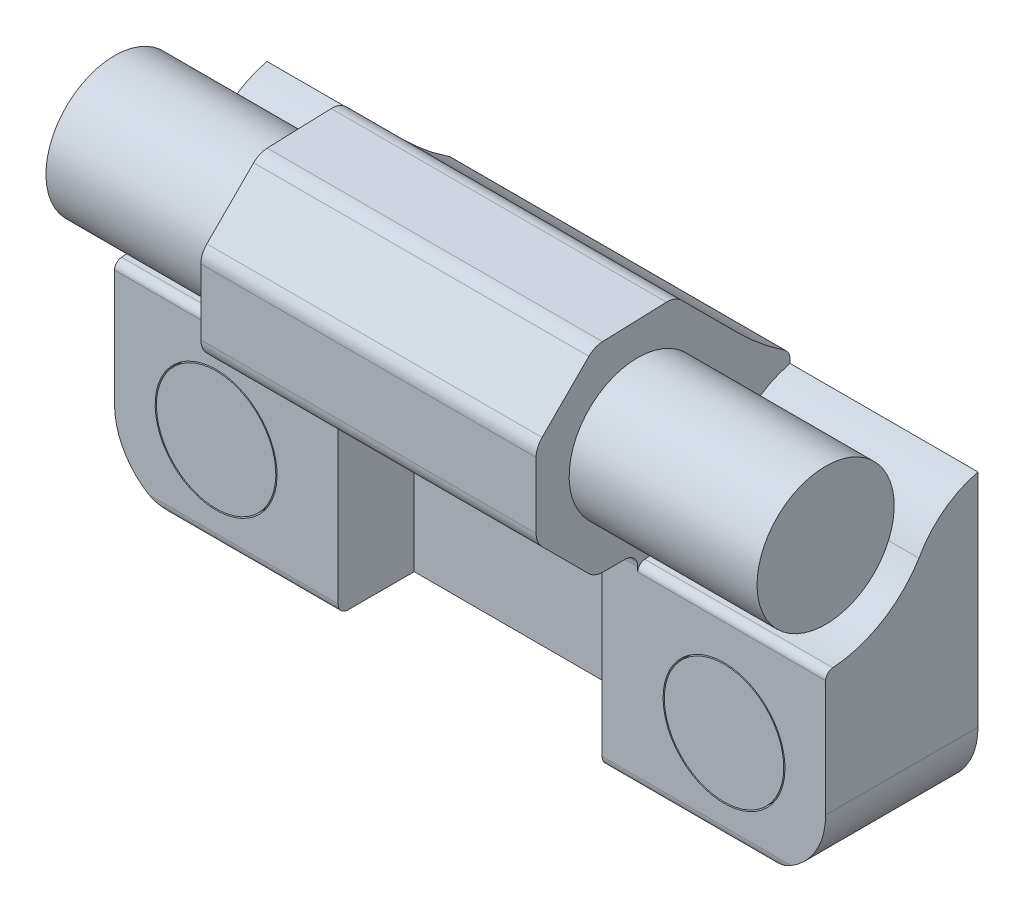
ISO-10303-21;
HEADER;
FILE_DESCRIPTION(('STEP AP214'),'2;1');
FILE_NAME('part.step','',(''),(''),'','','');
FILE_SCHEMA(('AUTOMOTIVE_DESIGN { 1 0 10303 214 1 1 1 1 }'));
ENDSEC;
DATA;
#1=APPLICATION_CONTEXT('core data for automotive mechanical design processes');
#2=APPLICATION_PROTOCOL_DEFINITION('international standard','automotive_design',2000,#1);
#3=PRODUCT_CONTEXT('',#1,'mechanical');
#4=PRODUCT('Part','Part','',(#3));
#5=PRODUCT_RELATED_PRODUCT_CATEGORY('part','',(#4));
#6=PRODUCT_DEFINITION_FORMATION('','',#4);
#7=PRODUCT_DEFINITION_CONTEXT('part definition',#1,'design');
#8=PRODUCT_DEFINITION('design','',#6,#7);
#9=PRODUCT_DEFINITION_SHAPE('','',#8);
#10=(LENGTH_UNIT() NAMED_UNIT(*) SI_UNIT(.MILLI.,.METRE.));
#11=(NAMED_UNIT(*) PLANE_ANGLE_UNIT() SI_UNIT($,.RADIAN.));
#12=(NAMED_UNIT(*) SI_UNIT($,.STERADIAN.) SOLID_ANGLE_UNIT());
#13=UNCERTAINTY_MEASURE_WITH_UNIT(LENGTH_MEASURE(1.E-05),#10,'distance_accuracy_value','');
#14=(GEOMETRIC_REPRESENTATION_CONTEXT(3) GLOBAL_UNCERTAINTY_ASSIGNED_CONTEXT((#13)) GLOBAL_UNIT_ASSIGNED_CONTEXT((#10,
#11,#12)) REPRESENTATION_CONTEXT('',''));
#15=CARTESIAN_POINT('',(0.,0.,0.));
#16=DIRECTION('',(0.,0.,1.));
#17=DIRECTION('',(1.,0.,0.));
#18=AXIS2_PLACEMENT_3D('',#15,#16,#17);
#19=CARTESIAN_POINT('',(41.5,9.46435524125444,14.2500000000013));
#20=DIRECTION('',(1.,0.,0.));
#21=DIRECTION('',(0.,1.,0.));
#22=AXIS2_PLACEMENT_3D('',#19,#20,#21);
#23=PLANE('',#22);
#24=CARTESIAN_POINT('',(41.5,20.1057282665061,1.30000000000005));
#25=DIRECTION('',(1.,0.,0.));
#26=DIRECTION('',(0.,1.,0.));
#27=AXIS2_PLACEMENT_3D('',#24,#25,#26);
#28=CIRCLE('',#27,1.30000000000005);
#29=CARTESIAN_POINT('',(41.5,20.1057282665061,0.));
#30=VERTEX_POINT('',#29);
#31=CARTESIAN_POINT('',(41.5,21.1868689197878,0.578103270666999));
#32=VERTEX_POINT('',#31);
#33=EDGE_CURVE('E463',#30,#32,#28,.T.);
#34=ORIENTED_EDGE('',*,*,#33,.T.);
#35=CARTESIAN_POINT('',(41.5,45.9399999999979,-15.9499999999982));
#36=DIRECTION('',(1.,0.,0.));
#37=DIRECTION('',(0.,1.,0.));
#38=AXIS2_PLACEMENT_3D('',#35,#36,#37);
#39=CIRCLE('',#38,29.7639999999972);
#40=CARTESIAN_POINT('',(41.5,24.9695527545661,5.1719326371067));
#41=VERTEX_POINT('',#40);
#42=EDGE_CURVE('E460',#41,#32,#39,.T.);
#43=ORIENTED_EDGE('',*,*,#42,.F.);
#44=DIRECTION('',(0.,0.707106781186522,0.707106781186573));
#45=VECTOR('',#44,1.);
#46=CARTESIAN_POINT('',(41.5,24.9695527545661,5.1719326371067));
#47=LINE('',#46,#45);
#48=CARTESIAN_POINT('',(41.5,30.482702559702,10.685082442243));
#49=VERTEX_POINT('',#48);
#50=EDGE_CURVE('E458',#41,#49,#47,.T.);
#51=ORIENTED_EDGE('',*,*,#50,.T.);
#52=CARTESIAN_POINT('',(41.5,29.0684889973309,12.0992960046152));
#53=DIRECTION('',(1.,0.,0.));
#54=DIRECTION('',(0.,1.,0.));
#55=AXIS2_PLACEMENT_3D('',#52,#53,#54);
#56=CIRCLE('',#55,1.99999999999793);
#57=CARTESIAN_POINT('',(41.5,31.067270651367,12.169094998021));
#58=VERTEX_POINT('',#57);
#59=EDGE_CURVE('E456',#49,#58,#56,.T.);
#60=ORIENTED_EDGE('',*,*,#59,.T.);
#61=DIRECTION('',(0.,-0.0348994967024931,0.999390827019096));
#62=VECTOR('',#61,1.);
#63=CARTESIAN_POINT('',(41.5,31.067270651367,12.169094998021));
#64=LINE('',#63,#62);
#65=CARTESIAN_POINT('',(41.5,30.8474945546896,18.462658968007));
#66=VERTEX_POINT('',#65);
#67=EDGE_CURVE('E454',#58,#66,#64,.T.);
#68=ORIENTED_EDGE('',*,*,#67,.T.);
#69=CARTESIAN_POINT('',(41.5,28.8487129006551,18.3928599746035));
#70=DIRECTION('',(1.,0.,0.));
#71=DIRECTION('',(0.,1.,0.));
#72=AXIS2_PLACEMENT_3D('',#69,#70,#71);
#73=CIRCLE('',#72,1.99999999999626);
#74=CARTESIAN_POINT('',(41.5,30.2629264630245,19.807073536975));
#75=VERTEX_POINT('',#74);
#76=EDGE_CURVE('E452',#66,#75,#73,.T.);
#77=ORIENTED_EDGE('',*,*,#76,.T.);
#78=DIRECTION('',(0.,-0.707106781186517,0.707106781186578));
#79=VECTOR('',#78,1.);
#80=CARTESIAN_POINT('',(41.5,30.2629264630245,19.807073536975));
#81=LINE('',#80,#79);
#82=CARTESIAN_POINT('',(41.5,25.6557864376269,24.414213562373));
#83=VERTEX_POINT('',#82);
#84=EDGE_CURVE('E450',#75,#83,#81,.T.);
#85=ORIENTED_EDGE('',*,*,#84,.T.);
#86=CARTESIAN_POINT('',(41.5,24.2415728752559,23.0000000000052));
#87=DIRECTION('',(1.,0.,0.));
#88=DIRECTION('',(0.,1.,0.));
#89=AXIS2_PLACEMENT_3D('',#86,#87,#88);
#90=CIRCLE('',#89,1.99999999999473);
#91=CARTESIAN_POINT('',(41.5,24.2415728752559,25.));
#92=VERTEX_POINT('',#91);
#93=EDGE_CURVE('E448',#83,#92,#90,.T.);
#94=ORIENTED_EDGE('',*,*,#93,.T.);
#95=DIRECTION('',(0.,-1.,0.));
#96=VECTOR('',#95,1.);
#97=CARTESIAN_POINT('',(41.5,24.2415728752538,25.));
#98=LINE('',#97,#96);
#99=CARTESIAN_POINT('',(41.5,17.7584271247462,25.));
#100=VERTEX_POINT('',#99);
#101=EDGE_CURVE('E446',#92,#100,#98,.T.);
#102=ORIENTED_EDGE('',*,*,#101,.T.);
#103=CARTESIAN_POINT('',(41.5,17.7584271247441,23.0000000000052));
#104=DIRECTION('',(1.,0.,0.));
#105=DIRECTION('',(0.,1.,0.));
#106=AXIS2_PLACEMENT_3D('',#103,#104,#105);
#107=CIRCLE('',#106,1.99999999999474);
#108=CARTESIAN_POINT('',(41.5,16.3442135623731,24.414213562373));
#109=VERTEX_POINT('',#108);
#110=EDGE_CURVE('E444',#100,#109,#107,.T.);
#111=ORIENTED_EDGE('',*,*,#110,.T.);
#112=DIRECTION('',(0.,-0.707106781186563,-0.707106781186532));
#113=VECTOR('',#112,1.);
#114=CARTESIAN_POINT('',(41.5,16.3442135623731,24.414213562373));
#115=LINE('',#114,#113);
#116=CARTESIAN_POINT('',(41.5,11.7657864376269,19.835786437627));
#117=VERTEX_POINT('',#116);
#118=EDGE_CURVE('E442',#109,#117,#115,.T.);
#119=ORIENTED_EDGE('',*,*,#118,.T.);
#120=CARTESIAN_POINT('',(41.5,13.1800000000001,18.4215728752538));
#121=DIRECTION('',(1.,0.,0.));
#122=DIRECTION('',(0.,1.,0.));
#123=AXIS2_PLACEMENT_3D('',#120,#121,#122);
#124=CIRCLE('',#123,2.00000000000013);
#125=CARTESIAN_POINT('',(41.5,11.18,18.4215728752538));
#126=VERTEX_POINT('',#125);
#127=EDGE_CURVE('E440',#117,#126,#124,.T.);
#128=ORIENTED_EDGE('',*,*,#127,.T.);
#129=DIRECTION('',(0.,0.,-1.));
#130=VECTOR('',#129,1.);
#131=CARTESIAN_POINT('',(41.5,11.18,18.421572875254));
#132=LINE('',#131,#130);
#133=CARTESIAN_POINT('',(41.5,11.18,16.2500000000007));
#134=VERTEX_POINT('',#133);
#135=EDGE_CURVE('E438',#126,#134,#132,.T.);
#136=ORIENTED_EDGE('',*,*,#135,.T.);
#137=CARTESIAN_POINT('',(41.5,9.92999999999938,16.2500000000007));
#138=DIRECTION('',(1.,0.,0.));
#139=DIRECTION('',(0.,1.,0.));
#140=AXIS2_PLACEMENT_3D('',#137,#138,#139);
#141=CIRCLE('',#140,1.25000000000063);
#142=CARTESIAN_POINT('',(41.5,9.92999999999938,15.));
#143=VERTEX_POINT('',#142);
#144=EDGE_CURVE('E435',#143,#134,#141,.T.);
#145=ORIENTED_EDGE('',*,*,#144,.F.);
#146=DIRECTION('',(0.,-1.,0.));
#147=VECTOR('',#146,1.);
#148=CARTESIAN_POINT('',(41.5,9.93,15.));
#149=LINE('',#148,#147);
#150=CARTESIAN_POINT('',(41.5,9.46435524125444,15.));
#151=VERTEX_POINT('',#150);
#152=EDGE_CURVE('E586',#143,#151,#149,.T.);
#153=ORIENTED_EDGE('',*,*,#152,.T.);
#154=CARTESIAN_POINT('',(41.5,9.46435524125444,14.2500000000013));
#155=DIRECTION('',(1.,0.,0.));
#156=DIRECTION('',(0.,1.,0.));
#157=AXIS2_PLACEMENT_3D('',#154,#155,#156);
#158=CIRCLE('',#157,0.749999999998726);
#159=CARTESIAN_POINT('',(41.5,10.212775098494,14.298659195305));
#160=VERTEX_POINT('',#159);
#161=EDGE_CURVE('E407',#160,#151,#158,.T.);
#162=ORIENTED_EDGE('',*,*,#161,.F.);
#163=CARTESIAN_POINT('',(41.5,21.,15.));
#164=DIRECTION('',(1.,0.,0.));
#165=DIRECTION('',(0.,1.,0.));
#166=AXIS2_PLACEMENT_3D('',#163,#164,#165);
#167=CIRCLE('',#166,10.8100000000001);
#168=CARTESIAN_POINT('',(41.5,15.3060612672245,5.8111392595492));
#169=VERTEX_POINT('',#168);
#170=EDGE_CURVE('E410',#160,#169,#167,.T.);
#171=ORIENTED_EDGE('',*,*,#170,.T.);
#172=CARTESIAN_POINT('',(41.5,11.0200000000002,-2.07999999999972));
#173=DIRECTION('',(1.,0.,0.));
#174=DIRECTION('',(0.,1.,0.));
#175=AXIS2_PLACEMENT_3D('',#172,#173,#174);
#176=CIRCLE('',#175,8.97999999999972);
#177=CARTESIAN_POINT('',(41.5,19.7557884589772,0.));
#178=VERTEX_POINT('',#177);
#179=EDGE_CURVE('E414',#178,#169,#176,.T.);
#180=ORIENTED_EDGE('',*,*,#179,.F.);
#181=DIRECTION('',(0.,1.,0.));
#182=VECTOR('',#181,1.);
#183=CARTESIAN_POINT('',(41.5,19.7557884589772,0.));
#184=LINE('',#183,#182);
#185=EDGE_CURVE('E417',#178,#30,#184,.T.);
#186=ORIENTED_EDGE('',*,*,#185,.T.);
#187=EDGE_LOOP('',(#34,#43,#51,#60,#68,#77,#85,#94,#102,#111,#119,#128,#136,#145,#153,#162,#171,
#180,#186));
#188=FACE_BOUND('',#187,.T.);
#189=CARTESIAN_POINT('',(41.5,21.,15.));
#190=DIRECTION('',(1.,0.,0.));
#191=DIRECTION('',(0.,1.,0.));
#192=AXIS2_PLACEMENT_3D('',#189,#190,#191);
#193=CIRCLE('',#192,6.75);
#194=CARTESIAN_POINT('',(41.5,27.75,15.));
#195=VERTEX_POINT('',#194);
#196=EDGE_CURVE('E273',#195,#195,#193,.F.);
#197=ORIENTED_EDGE('',*,*,#196,.T.);
#198=EDGE_LOOP('',(#197));
#199=FACE_BOUND('',#198,.T.);
#200=ADVANCED_FACE('F14',(#188,#199),#23,.T.);
#201=CARTESIAN_POINT('',(8.5,9.46435524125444,14.2500000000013));
#202=DIRECTION('',(1.,0.,0.));
#203=DIRECTION('',(0.,1.,0.));
#204=AXIS2_PLACEMENT_3D('',#201,#202,#203);
#205=PLANE('',#204);
#206=DIRECTION('',(0.,1.,0.));
#207=VECTOR('',#206,1.);
#208=CARTESIAN_POINT('',(8.5,19.7557884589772,0.));
#209=LINE('',#208,#207);
#210=CARTESIAN_POINT('',(8.5,19.7557884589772,0.));
#211=VERTEX_POINT('',#210);
#212=CARTESIAN_POINT('',(8.5,20.1057282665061,0.));
#213=VERTEX_POINT('',#212);
#214=EDGE_CURVE('E349',#211,#213,#209,.T.);
#215=ORIENTED_EDGE('',*,*,#214,.F.);
#216=CARTESIAN_POINT('',(8.5,11.0200000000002,-2.07999999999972));
#217=DIRECTION('',(1.,0.,0.));
#218=DIRECTION('',(0.,1.,0.));
#219=AXIS2_PLACEMENT_3D('',#216,#217,#218);
#220=CIRCLE('',#219,8.97999999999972);
#221=CARTESIAN_POINT('',(8.5,15.3060612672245,5.8111392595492));
#222=VERTEX_POINT('',#221);
#223=EDGE_CURVE('E346',#211,#222,#220,.T.);
#224=ORIENTED_EDGE('',*,*,#223,.T.);
#225=CARTESIAN_POINT('',(8.5,21.,15.));
#226=DIRECTION('',(1.,0.,0.));
#227=DIRECTION('',(0.,1.,0.));
#228=AXIS2_PLACEMENT_3D('',#225,#226,#227);
#229=CIRCLE('',#228,10.8100000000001);
#230=CARTESIAN_POINT('',(8.5,10.212775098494,14.298659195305));
#231=VERTEX_POINT('',#230);
#232=EDGE_CURVE('E343',#231,#222,#229,.T.);
#233=ORIENTED_EDGE('',*,*,#232,.F.);
#234=CARTESIAN_POINT('',(8.5,9.46435524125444,14.2500000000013));
#235=DIRECTION('',(1.,0.,0.));
#236=DIRECTION('',(0.,1.,0.));
#237=AXIS2_PLACEMENT_3D('',#234,#235,#236);
#238=CIRCLE('',#237,0.749999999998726);
#239=CARTESIAN_POINT('',(8.5,9.46435524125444,15.));
#240=VERTEX_POINT('',#239);
#241=EDGE_CURVE('E340',#231,#240,#238,.T.);
#242=ORIENTED_EDGE('',*,*,#241,.T.);
#243=DIRECTION('',(0.,-1.,0.));
#244=VECTOR('',#243,1.);
#245=CARTESIAN_POINT('',(8.5,9.93,15.));
#246=LINE('',#245,#244);
#247=CARTESIAN_POINT('',(8.5,9.92999999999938,15.));
#248=VERTEX_POINT('',#247);
#249=EDGE_CURVE('E588',#248,#240,#246,.T.);
#250=ORIENTED_EDGE('',*,*,#249,.F.);
#251=CARTESIAN_POINT('',(8.5,9.92999999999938,16.2500000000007));
#252=DIRECTION('',(1.,0.,0.));
#253=DIRECTION('',(0.,1.,0.));
#254=AXIS2_PLACEMENT_3D('',#251,#252,#253);
#255=CIRCLE('',#254,1.25000000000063);
#256=CARTESIAN_POINT('',(8.5,11.18,16.2500000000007));
#257=VERTEX_POINT('',#256);
#258=EDGE_CURVE('E365',#248,#257,#255,.T.);
#259=ORIENTED_EDGE('',*,*,#258,.T.);
#260=DIRECTION('',(0.,0.,-1.));
#261=VECTOR('',#260,1.);
#262=CARTESIAN_POINT('',(8.5,11.18,18.421572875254));
#263=LINE('',#262,#261);
#264=CARTESIAN_POINT('',(8.5,11.18,18.4215728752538));
#265=VERTEX_POINT('',#264);
#266=EDGE_CURVE('E368',#265,#257,#263,.T.);
#267=ORIENTED_EDGE('',*,*,#266,.F.);
#268=CARTESIAN_POINT('',(8.5,13.1800000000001,18.4215728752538));
#269=DIRECTION('',(1.,0.,0.));
#270=DIRECTION('',(0.,1.,0.));
#271=AXIS2_PLACEMENT_3D('',#268,#269,#270);
#272=CIRCLE('',#271,2.00000000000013);
#273=CARTESIAN_POINT('',(8.5,11.7657864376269,19.835786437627));
#274=VERTEX_POINT('',#273);
#275=EDGE_CURVE('E371',#274,#265,#272,.T.);
#276=ORIENTED_EDGE('',*,*,#275,.F.);
#277=DIRECTION('',(0.,-0.707106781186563,-0.707106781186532));
#278=VECTOR('',#277,1.);
#279=CARTESIAN_POINT('',(8.5,16.3442135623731,24.414213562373));
#280=LINE('',#279,#278);
#281=CARTESIAN_POINT('',(8.5,16.3442135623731,24.414213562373));
#282=VERTEX_POINT('',#281);
#283=EDGE_CURVE('E374',#282,#274,#280,.T.);
#284=ORIENTED_EDGE('',*,*,#283,.F.);
#285=CARTESIAN_POINT('',(8.5,17.7584271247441,23.0000000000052));
#286=DIRECTION('',(1.,0.,0.));
#287=DIRECTION('',(0.,1.,0.));
#288=AXIS2_PLACEMENT_3D('',#285,#286,#287);
#289=CIRCLE('',#288,1.99999999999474);
#290=CARTESIAN_POINT('',(8.5,17.7584271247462,25.));
#291=VERTEX_POINT('',#290);
#292=EDGE_CURVE('E377',#291,#282,#289,.T.);
#293=ORIENTED_EDGE('',*,*,#292,.F.);
#294=DIRECTION('',(0.,-1.,0.));
#295=VECTOR('',#294,1.);
#296=CARTESIAN_POINT('',(8.5,24.2415728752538,25.));
#297=LINE('',#296,#295);
#298=CARTESIAN_POINT('',(8.5,24.2415728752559,25.));
#299=VERTEX_POINT('',#298);
#300=EDGE_CURVE('E380',#299,#291,#297,.T.);
#301=ORIENTED_EDGE('',*,*,#300,.F.);
#302=CARTESIAN_POINT('',(8.5,24.2415728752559,23.0000000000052));
#303=DIRECTION('',(1.,0.,0.));
#304=DIRECTION('',(0.,1.,0.));
#305=AXIS2_PLACEMENT_3D('',#302,#303,#304);
#306=CIRCLE('',#305,1.99999999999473);
#307=CARTESIAN_POINT('',(8.5,25.6557864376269,24.414213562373));
#308=VERTEX_POINT('',#307);
#309=EDGE_CURVE('E383',#308,#299,#306,.T.);
#310=ORIENTED_EDGE('',*,*,#309,.F.);
#311=DIRECTION('',(0.,-0.707106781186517,0.707106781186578));
#312=VECTOR('',#311,1.);
#313=CARTESIAN_POINT('',(8.5,30.2629264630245,19.807073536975));
#314=LINE('',#313,#312);
#315=CARTESIAN_POINT('',(8.5,30.2629264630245,19.807073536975));
#316=VERTEX_POINT('',#315);
#317=EDGE_CURVE('E386',#316,#308,#314,.T.);
#318=ORIENTED_EDGE('',*,*,#317,.F.);
#319=CARTESIAN_POINT('',(8.5,28.8487129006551,18.3928599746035));
#320=DIRECTION('',(1.,0.,0.));
#321=DIRECTION('',(0.,1.,0.));
#322=AXIS2_PLACEMENT_3D('',#319,#320,#321);
#323=CIRCLE('',#322,1.99999999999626);
#324=CARTESIAN_POINT('',(8.5,30.8474945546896,18.462658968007));
#325=VERTEX_POINT('',#324);
#326=EDGE_CURVE('E389',#325,#316,#323,.T.);
#327=ORIENTED_EDGE('',*,*,#326,.F.);
#328=DIRECTION('',(0.,-0.0348994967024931,0.999390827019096));
#329=VECTOR('',#328,1.);
#330=CARTESIAN_POINT('',(8.5,31.067270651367,12.169094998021));
#331=LINE('',#330,#329);
#332=CARTESIAN_POINT('',(8.5,31.067270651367,12.169094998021));
#333=VERTEX_POINT('',#332);
#334=EDGE_CURVE('E392',#333,#325,#331,.T.);
#335=ORIENTED_EDGE('',*,*,#334,.F.);
#336=CARTESIAN_POINT('',(8.5,29.0684889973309,12.0992960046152));
#337=DIRECTION('',(1.,0.,0.));
#338=DIRECTION('',(0.,1.,0.));
#339=AXIS2_PLACEMENT_3D('',#336,#337,#338);
#340=CIRCLE('',#339,1.99999999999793);
#341=CARTESIAN_POINT('',(8.5,30.482702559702,10.685082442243));
#342=VERTEX_POINT('',#341);
#343=EDGE_CURVE('E395',#342,#333,#340,.T.);
#344=ORIENTED_EDGE('',*,*,#343,.F.);
#345=DIRECTION('',(0.,0.707106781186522,0.707106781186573));
#346=VECTOR('',#345,1.);
#347=CARTESIAN_POINT('',(8.5,24.9695527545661,5.1719326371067));
#348=LINE('',#347,#346);
#349=CARTESIAN_POINT('',(8.5,24.9695527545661,5.1719326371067));
#350=VERTEX_POINT('',#349);
#351=EDGE_CURVE('E398',#350,#342,#348,.T.);
#352=ORIENTED_EDGE('',*,*,#351,.F.);
#353=CARTESIAN_POINT('',(8.5,45.9399999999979,-15.9499999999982));
#354=DIRECTION('',(1.,0.,0.));
#355=DIRECTION('',(0.,1.,0.));
#356=AXIS2_PLACEMENT_3D('',#353,#354,#355);
#357=CIRCLE('',#356,29.7639999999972);
#358=CARTESIAN_POINT('',(8.5,21.1868689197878,0.578103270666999));
#359=VERTEX_POINT('',#358);
#360=EDGE_CURVE('E401',#350,#359,#357,.T.);
#361=ORIENTED_EDGE('',*,*,#360,.T.);
#362=CARTESIAN_POINT('',(8.5,20.1057282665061,1.30000000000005));
#363=DIRECTION('',(1.,0.,0.));
#364=DIRECTION('',(0.,1.,0.));
#365=AXIS2_PLACEMENT_3D('',#362,#363,#364);
#366=CIRCLE('',#365,1.30000000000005);
#367=EDGE_CURVE('E403',#213,#359,#366,.T.);
#368=ORIENTED_EDGE('',*,*,#367,.F.);
#369=EDGE_LOOP('',(#215,#224,#233,#242,#250,#259,#267,#276,#284,#293,#301,#310,#318,#327,#335,
#344,#352,#361,#368));
#370=FACE_BOUND('',#369,.T.);
#371=CARTESIAN_POINT('',(8.5,21.,15.));
#372=DIRECTION('',(1.,0.,0.));
#373=DIRECTION('',(0.,1.,0.));
#374=AXIS2_PLACEMENT_3D('',#371,#372,#373);
#375=CIRCLE('',#374,6.75);
#376=CARTESIAN_POINT('',(8.5,27.75,15.));
#377=VERTEX_POINT('',#376);
#378=EDGE_CURVE('E9',#377,#377,#375,.F.);
#379=ORIENTED_EDGE('',*,*,#378,.F.);
#380=EDGE_LOOP('',(#379));
#381=FACE_BOUND('',#380,.T.);
#382=ADVANCED_FACE('F638',(#370,#381),#205,.F.);
#383=CARTESIAN_POINT('',(60.,9.93,15.));
#384=DIRECTION('',(0.,0.,-1.));
#385=DIRECTION('',(-1.,0.,0.));
#386=AXIS2_PLACEMENT_3D('',#383,#384,#385);
#387=PLANE('',#386);
#388=CARTESIAN_POINT('',(0.,0.,15.));
#389=DIRECTION('',(0.,0.,1.));
#390=DIRECTION('',(0.,1.,0.));
#391=AXIS2_PLACEMENT_3D('',#388,#389,#390);
#392=CIRCLE('',#391,6.);
#393=CARTESIAN_POINT('',(0.,6.,15.));
#394=VERTEX_POINT('',#393);
#395=EDGE_CURVE('E315',#394,#394,#392,.T.);
#396=ORIENTED_EDGE('',*,*,#395,.F.);
#397=EDGE_LOOP('',(#396));
#398=FACE_BOUND('',#397,.T.);
#399=DIRECTION('',(0.,-1.,0.));
#400=VECTOR('',#399,1.);
#401=CARTESIAN_POINT('',(12.,9.93,15.));
#402=LINE('',#401,#400);
#403=CARTESIAN_POINT('',(12.,9.92999999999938,15.));
#404=VERTEX_POINT('',#403);
#405=CARTESIAN_POINT('',(12.,-8.,15.));
#406=VERTEX_POINT('',#405);
#407=EDGE_CURVE('E29',#404,#406,#402,.T.);
#408=ORIENTED_EDGE('',*,*,#407,.F.);
#409=DIRECTION('',(-1.,0.,0.));
#410=VECTOR('',#409,1.);
#411=CARTESIAN_POINT('',(60.,9.92999999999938,15.));
#412=LINE('',#411,#410);
#413=EDGE_CURVE('E536',#404,#248,#412,.T.);
#414=ORIENTED_EDGE('',*,*,#413,.T.);
#415=ORIENTED_EDGE('',*,*,#249,.T.);
#416=DIRECTION('',(-1.,0.,0.));
#417=VECTOR('',#416,1.);
#418=CARTESIAN_POINT('',(8.5,9.46435524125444,15.));
#419=LINE('',#418,#417);
#420=CARTESIAN_POINT('',(-10.,9.46435524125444,15.));
#421=VERTEX_POINT('',#420);
#422=EDGE_CURVE('E362',#240,#421,#419,.T.);
#423=ORIENTED_EDGE('',*,*,#422,.T.);
#424=DIRECTION('',(0.,-1.,0.));
#425=VECTOR('',#424,1.);
#426=CARTESIAN_POINT('',(-10.,9.93,15.));
#427=LINE('',#426,#425);
#428=CARTESIAN_POINT('',(-10.,-2.00000000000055,15.));
#429=VERTEX_POINT('',#428);
#430=EDGE_CURVE('E525',#421,#429,#427,.T.);
#431=ORIENTED_EDGE('',*,*,#430,.T.);
#432=CARTESIAN_POINT('',(-3.0000000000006,-2.00000000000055,15.));
#433=DIRECTION('',(0.,0.,-1.));
#434=DIRECTION('',(-1.,0.,0.));
#435=AXIS2_PLACEMENT_3D('',#432,#433,#434);
#436=CIRCLE('',#435,6.99999999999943);
#437=CARTESIAN_POINT('',(-6.6055512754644,-8.,15.));
#438=VERTEX_POINT('',#437);
#439=EDGE_CURVE('E484',#429,#438,#436,.F.);
#440=ORIENTED_EDGE('',*,*,#439,.T.);
#441=DIRECTION('',(-1.,0.,0.));
#442=VECTOR('',#441,1.);
#443=CARTESIAN_POINT('',(60.,-8.,15.));
#444=LINE('',#443,#442);
#445=EDGE_CURVE('E532',#406,#438,#444,.T.);
#446=ORIENTED_EDGE('',*,*,#445,.F.);
#447=EDGE_LOOP('',(#408,#414,#415,#423,#431,#440,#446));
#448=FACE_BOUND('',#447,.T.);
#449=ADVANCED_FACE('F622',(#398,#448),#387,.F.);
#450=CARTESIAN_POINT('',(60.,9.92999999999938,16.2500000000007));
#451=DIRECTION('',(-1.,0.,0.));
#452=DIRECTION('',(0.,-1.,0.));
#453=AXIS2_PLACEMENT_3D('',#450,#451,#452);
#454=CYLINDRICAL_SURFACE('',#453,1.25000000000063);
#455=ORIENTED_EDGE('',*,*,#413,.F.);
#456=CARTESIAN_POINT('',(12.,9.92999999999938,16.2500000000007));
#457=DIRECTION('',(1.,0.,0.));
#458=DIRECTION('',(0.,1.,0.));
#459=AXIS2_PLACEMENT_3D('',#456,#457,#458);
#460=CIRCLE('',#459,1.25000000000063);
#461=CARTESIAN_POINT('',(12.,11.18,16.2500000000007));
#462=VERTEX_POINT('',#461);
#463=EDGE_CURVE('E289',#404,#462,#460,.T.);
#464=ORIENTED_EDGE('',*,*,#463,.T.);
#465=DIRECTION('',(-1.,0.,0.));
#466=VECTOR('',#465,1.);
#467=CARTESIAN_POINT('',(60.,11.18,16.25));
#468=LINE('',#467,#466);
#469=EDGE_CURVE('E540',#462,#257,#468,.T.);
#470=ORIENTED_EDGE('',*,*,#469,.T.);
#471=ORIENTED_EDGE('',*,*,#258,.F.);
#472=EDGE_LOOP('',(#455,#464,#470,#471));
#473=FACE_BOUND('',#472,.T.);
#474=ADVANCED_FACE('F980',(#473),#454,.F.);
#475=CARTESIAN_POINT('',(60.,-8.00000000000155,14.0000000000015));
#476=DIRECTION('',(-1.,0.,0.));
#477=DIRECTION('',(0.,-1.,0.));
#478=AXIS2_PLACEMENT_3D('',#475,#476,#477);
#479=CYLINDRICAL_SURFACE('',#478,0.999999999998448);
#480=CARTESIAN_POINT('',(12.,-8.00000000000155,14.0000000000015));
#481=DIRECTION('',(1.,0.,0.));
#482=DIRECTION('',(0.,1.,0.));
#483=AXIS2_PLACEMENT_3D('',#480,#481,#482);
#484=CIRCLE('',#483,0.999999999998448);
#485=CARTESIAN_POINT('',(12.,-9.,14.0000000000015));
#486=VERTEX_POINT('',#485);
#487=EDGE_CURVE('E591',#406,#486,#484,.T.);
#488=ORIENTED_EDGE('',*,*,#487,.F.);
#489=ORIENTED_EDGE('',*,*,#445,.T.);
#490=CARTESIAN_POINT('',(-6.6055512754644,-8.,15.));
#491=CARTESIAN_POINT('',(-6.55494177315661,-8.0304138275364,14.9999929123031));
#492=CARTESIAN_POINT('',(-6.50396296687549,-8.06017529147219,14.9986134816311));
#493=CARTESIAN_POINT('',(-6.40138529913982,-8.11833715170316,14.9934039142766));
#494=CARTESIAN_POINT('',(-6.34978671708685,-8.1467381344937,14.989574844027));
#495=CARTESIAN_POINT('',(-6.19441978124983,-8.22972265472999,14.9748751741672));
#496=CARTESIAN_POINT('',(-6.08983806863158,-8.28223313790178,14.9607892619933));
#497=CARTESIAN_POINT('',(-5.87967288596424,-8.3812947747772,14.9259356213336));
#498=CARTESIAN_POINT('',(-5.77409682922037,-8.42787385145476,14.9052009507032));
#499=CARTESIAN_POINT('',(-5.56173841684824,-8.51542025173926,14.8583738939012));
#500=CARTESIAN_POINT('',(-5.45495516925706,-8.55638308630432,14.8322772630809));
#501=CARTESIAN_POINT('',(-5.15662199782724,-8.66259073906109,14.7537528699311));
#502=CARTESIAN_POINT('',(-4.96409833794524,-8.72176788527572,14.6966952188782));
#503=CARTESIAN_POINT('',(-4.57742895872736,-8.82288362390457,14.5737581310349));
#504=CARTESIAN_POINT('',(-4.383282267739,-8.86481100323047,14.5078729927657));
#505=CARTESIAN_POINT('',(-3.79892919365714,-8.9654801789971,14.3019885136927));
#506=CARTESIAN_POINT('',(-3.40681178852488,-8.99910832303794,14.1537607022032));
#507=CARTESIAN_POINT('',(-3.01043481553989,-8.99999416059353,14.0039439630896));
#508=CARTESIAN_POINT('',(-3.00521731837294,-8.99999999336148,14.0019719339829));
#509=CARTESIAN_POINT('',(-3.0000000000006,-9.,14.0000000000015));
#510=B_SPLINE_CURVE_WITH_KNOTS('',3,(#490,#491,#492,#493,#494,#495,#496,#497,#498,#499,#500,
#501,#502,#503,#504,#505,#506,#507,#508,#509),.UNSPECIFIED.,.F.,.F.,(4,2,2,2,2,2,2,2,2,4),(0.,
0.177083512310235,0.354089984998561,0.707258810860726,1.0586982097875,1.41041689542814,
2.03723640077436,2.66446272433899,3.91892182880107,3.93565503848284),.UNSPECIFIED.);
#511=CARTESIAN_POINT('',(-3.,-9.,14.0000000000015));
#512=VERTEX_POINT('',#511);
#513=EDGE_CURVE('E475',#438,#512,#510,.T.);
#514=ORIENTED_EDGE('',*,*,#513,.T.);
#515=DIRECTION('',(-1.,0.,0.));
#516=VECTOR('',#515,1.);
#517=CARTESIAN_POINT('',(60.,-9.,14.0000000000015));
#518=LINE('',#517,#516);
#519=EDGE_CURVE('E527',#486,#512,#518,.T.);
#520=ORIENTED_EDGE('',*,*,#519,.F.);
#521=EDGE_LOOP('',(#488,#489,#514,#520));
#522=FACE_BOUND('',#521,.T.);
#523=ADVANCED_FACE('F615',(#522),#479,.T.);
#524=CARTESIAN_POINT('',(60.,-9.,0.));
#525=DIRECTION('',(0.,0.,1.));
#526=DIRECTION('',(1.,0.,0.));
#527=AXIS2_PLACEMENT_3D('',#524,#525,#526);
#528=PLANE('',#527);
#529=CARTESIAN_POINT('',(50.,0.,0.));
#530=DIRECTION('',(0.,0.,1.));
#531=DIRECTION('',(1.,0.,0.));
#532=AXIS2_PLACEMENT_3D('',#529,#530,#531);
#533=CIRCLE('',#532,3.25);
#534=CARTESIAN_POINT('',(53.25,0.,0.));
#535=VERTEX_POINT('',#534);
#536=EDGE_CURVE('E312',#535,#535,#533,.T.);
#537=ORIENTED_EDGE('',*,*,#536,.T.);
#538=EDGE_LOOP('',(#537));
#539=FACE_BOUND('',#538,.T.);
#540=DIRECTION('',(0.,1.,0.));
#541=VECTOR('',#540,1.);
#542=CARTESIAN_POINT('',(-10.,-9.,0.));
#543=LINE('',#542,#541);
#544=CARTESIAN_POINT('',(-10.,-2.00000000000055,0.));
#545=VERTEX_POINT('',#544);
#546=CARTESIAN_POINT('',(-10.,19.7557884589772,0.));
#547=VERTEX_POINT('',#546);
#548=EDGE_CURVE('E520',#545,#547,#543,.T.);
#549=ORIENTED_EDGE('',*,*,#548,.T.);
#550=DIRECTION('',(-1.,0.,0.));
#551=VECTOR('',#550,1.);
#552=CARTESIAN_POINT('',(8.5,19.7557884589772,0.));
#553=LINE('',#552,#551);
#554=EDGE_CURVE('E37',#211,#547,#553,.T.);
#555=ORIENTED_EDGE('',*,*,#554,.F.);
#556=ORIENTED_EDGE('',*,*,#214,.T.);
#557=DIRECTION('',(-1.,0.,0.));
#558=VECTOR('',#557,1.);
#559=CARTESIAN_POINT('',(60.,20.1057282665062,0.));
#560=LINE('',#559,#558);
#561=EDGE_CURVE('E580',#30,#213,#560,.T.);
#562=ORIENTED_EDGE('',*,*,#561,.F.);
#563=ORIENTED_EDGE('',*,*,#185,.F.);
#564=DIRECTION('',(1.,0.,0.));
#565=VECTOR('',#564,1.);
#566=CARTESIAN_POINT('',(41.5,19.7557884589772,0.));
#567=LINE('',#566,#565);
#568=CARTESIAN_POINT('',(60.,19.7557884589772,0.));
#569=VERTEX_POINT('',#568);
#570=EDGE_CURVE('E419',#178,#569,#567,.T.);
#571=ORIENTED_EDGE('',*,*,#570,.T.);
#572=DIRECTION('',(0.,1.,0.));
#573=VECTOR('',#572,1.);
#574=CARTESIAN_POINT('',(60.,-9.,0.));
#575=LINE('',#574,#573);
#576=CARTESIAN_POINT('',(60.,-2.00000000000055,0.));
#577=VERTEX_POINT('',#576);
#578=EDGE_CURVE('E521',#577,#569,#575,.T.);
#579=ORIENTED_EDGE('',*,*,#578,.F.);
#580=CARTESIAN_POINT('',(53.0000000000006,-2.00000000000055,0.));
#581=DIRECTION('',(0.,0.,1.));
#582=DIRECTION('',(1.,0.,0.));
#583=AXIS2_PLACEMENT_3D('',#580,#581,#582);
#584=CIRCLE('',#583,6.99999999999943);
#585=CARTESIAN_POINT('',(53.0000000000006,-9.,0.));
#586=VERTEX_POINT('',#585);
#587=EDGE_CURVE('E517',#577,#586,#584,.F.);
#588=ORIENTED_EDGE('',*,*,#587,.T.);
#589=DIRECTION('',(-1.,0.,0.));
#590=VECTOR('',#589,1.);
#591=CARTESIAN_POINT('',(60.,-9.,0.));
#592=LINE('',#591,#590);
#593=CARTESIAN_POINT('',(-3.,-9.,0.));
#594=VERTEX_POINT('',#593);
#595=EDGE_CURVE('E583',#586,#594,#592,.T.);
#596=ORIENTED_EDGE('',*,*,#595,.T.);
#597=CARTESIAN_POINT('',(-3.0000000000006,-2.00000000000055,0.));
#598=DIRECTION('',(0.,0.,1.));
#599=DIRECTION('',(1.,0.,0.));
#600=AXIS2_PLACEMENT_3D('',#597,#598,#599);
#601=CIRCLE('',#600,6.99999999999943);
#602=EDGE_CURVE('E514',#594,#545,#601,.F.);
#603=ORIENTED_EDGE('',*,*,#602,.T.);
#604=EDGE_LOOP('',(#549,#555,#556,#562,#563,#571,#579,#588,#596,#603));
#605=FACE_BOUND('',#604,.T.);
#606=CARTESIAN_POINT('',(0.,0.,0.));
#607=DIRECTION('',(0.,0.,1.));
#608=DIRECTION('',(1.,0.,0.));
#609=AXIS2_PLACEMENT_3D('',#606,#607,#608);
#610=CIRCLE('',#609,3.25);
#611=CARTESIAN_POINT('',(3.25,0.,0.));
#612=VERTEX_POINT('',#611);
#613=EDGE_CURVE('E303',#612,#612,#610,.T.);
#614=ORIENTED_EDGE('',*,*,#613,.T.);
#615=EDGE_LOOP('',(#614));
#616=FACE_BOUND('',#615,.T.);
#617=ADVANCED_FACE('F627',(#539,#605,#616),#528,.F.);
#618=CARTESIAN_POINT('',(50.,0.,15.));
#619=DIRECTION('',(0.,0.,1.));
#620=DIRECTION('',(0.,1.,0.));
#621=AXIS2_PLACEMENT_3D('',#618,#619,#620);
#622=CIRCLE('',#621,6.);
#623=CARTESIAN_POINT('',(50.,6.,15.));
#624=VERTEX_POINT('',#623);
#625=EDGE_CURVE('E319',#624,#624,#622,.T.);
#626=ORIENTED_EDGE('',*,*,#625,.F.);
#627=EDGE_LOOP('',(#626));
#628=FACE_BOUND('',#627,.T.);
#629=CARTESIAN_POINT('',(38.,9.92999999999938,15.));
#630=VERTEX_POINT('',#629);
#631=EDGE_CURVE('E537',#143,#630,#412,.T.);
#632=ORIENTED_EDGE('',*,*,#631,.T.);
#633=DIRECTION('',(0.,-1.,0.));
#634=VECTOR('',#633,1.);
#635=CARTESIAN_POINT('',(38.,9.93,15.));
#636=LINE('',#635,#634);
#637=CARTESIAN_POINT('',(38.,-8.,15.));
#638=VERTEX_POINT('',#637);
#639=EDGE_CURVE('E292',#630,#638,#636,.T.);
#640=ORIENTED_EDGE('',*,*,#639,.T.);
#641=CARTESIAN_POINT('',(56.6055512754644,-8.,15.));
#642=VERTEX_POINT('',#641);
#643=EDGE_CURVE('E533',#642,#638,#444,.T.);
#644=ORIENTED_EDGE('',*,*,#643,.F.);
#645=CARTESIAN_POINT('',(53.0000000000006,-2.00000000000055,15.));
#646=DIRECTION('',(0.,0.,-1.));
#647=DIRECTION('',(-1.,0.,0.));
#648=AXIS2_PLACEMENT_3D('',#645,#646,#647);
#649=CIRCLE('',#648,6.99999999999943);
#650=CARTESIAN_POINT('',(60.,-2.,15.));
#651=VERTEX_POINT('',#650);
#652=EDGE_CURVE('E513',#642,#651,#649,.F.);
#653=ORIENTED_EDGE('',*,*,#652,.T.);
#654=DIRECTION('',(0.,-1.,0.));
#655=VECTOR('',#654,1.);
#656=CARTESIAN_POINT('',(60.,9.93,15.));
#657=LINE('',#656,#655);
#658=CARTESIAN_POINT('',(60.,9.46435524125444,15.));
#659=VERTEX_POINT('',#658);
#660=EDGE_CURVE('E524',#659,#651,#657,.T.);
#661=ORIENTED_EDGE('',*,*,#660,.F.);
#662=DIRECTION('',(1.,0.,0.));
#663=VECTOR('',#662,1.);
#664=CARTESIAN_POINT('',(41.5,9.46435524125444,15.));
#665=LINE('',#664,#663);
#666=EDGE_CURVE('E433',#151,#659,#665,.T.);
#667=ORIENTED_EDGE('',*,*,#666,.F.);
#668=ORIENTED_EDGE('',*,*,#152,.F.);
#669=EDGE_LOOP('',(#632,#640,#644,#653,#661,#667,#668));
#670=FACE_BOUND('',#669,.T.);
#671=ADVANCED_FACE('F596',(#628,#670),#387,.F.);
#672=CARTESIAN_POINT('',(60.,20.1057282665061,1.30000000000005));
#673=DIRECTION('',(-1.,0.,0.));
#674=DIRECTION('',(0.,-1.,0.));
#675=AXIS2_PLACEMENT_3D('',#672,#673,#674);
#676=CYLINDRICAL_SURFACE('',#675,1.30000000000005);
#677=ORIENTED_EDGE('',*,*,#561,.T.);
#678=ORIENTED_EDGE('',*,*,#367,.T.);
#679=DIRECTION('',(-1.,0.,0.));
#680=VECTOR('',#679,1.);
#681=CARTESIAN_POINT('',(60.,21.1868689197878,0.578103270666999));
#682=LINE('',#681,#680);
#683=EDGE_CURVE('E577',#32,#359,#682,.T.);
#684=ORIENTED_EDGE('',*,*,#683,.F.);
#685=ORIENTED_EDGE('',*,*,#33,.F.);
#686=EDGE_LOOP('',(#677,#678,#684,#685));
#687=FACE_BOUND('',#686,.T.);
#688=ADVANCED_FACE('F645',(#687),#676,.T.);
#689=CARTESIAN_POINT('',(60.,45.9399999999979,-15.9499999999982));
#690=DIRECTION('',(-1.,0.,0.));
#691=DIRECTION('',(0.,-1.,0.));
#692=AXIS2_PLACEMENT_3D('',#689,#690,#691);
#693=CYLINDRICAL_SURFACE('',#692,29.7639999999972);
#694=ORIENTED_EDGE('',*,*,#360,.F.);
#695=DIRECTION('',(-1.,0.,0.));
#696=VECTOR('',#695,1.);
#697=CARTESIAN_POINT('',(60.,24.9695527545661,5.1719326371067));
#698=LINE('',#697,#696);
#699=EDGE_CURVE('E574',#41,#350,#698,.T.);
#700=ORIENTED_EDGE('',*,*,#699,.F.);
#701=ORIENTED_EDGE('',*,*,#42,.T.);
#702=ORIENTED_EDGE('',*,*,#683,.T.);
#703=EDGE_LOOP('',(#694,#700,#701,#702));
#704=FACE_BOUND('',#703,.T.);
#705=ADVANCED_FACE('F654',(#704),#693,.F.);
#706=CARTESIAN_POINT('',(60.,24.9695527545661,5.1719326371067));
#707=DIRECTION('',(0.,-0.707106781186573,0.707106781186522));
#708=DIRECTION('',(0.,-0.707106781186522,-0.707106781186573));
#709=AXIS2_PLACEMENT_3D('',#706,#707,#708);
#710=PLANE('',#709);
#711=ORIENTED_EDGE('',*,*,#699,.T.);
#712=ORIENTED_EDGE('',*,*,#351,.T.);
#713=DIRECTION('',(-1.,0.,0.));
#714=VECTOR('',#713,1.);
#715=CARTESIAN_POINT('',(60.,30.482702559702,10.685082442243));
#716=LINE('',#715,#714);
#717=EDGE_CURVE('E571',#49,#342,#716,.T.);
#718=ORIENTED_EDGE('',*,*,#717,.F.);
#719=ORIENTED_EDGE('',*,*,#50,.F.);
#720=EDGE_LOOP('',(#711,#712,#718,#719));
#721=FACE_BOUND('',#720,.T.);
#722=ADVANCED_FACE('F656',(#721),#710,.F.);
#723=CARTESIAN_POINT('',(60.,29.0684889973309,12.0992960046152));
#724=DIRECTION('',(-1.,0.,0.));
#725=DIRECTION('',(0.,-1.,0.));
#726=AXIS2_PLACEMENT_3D('',#723,#724,#725);
#727=CYLINDRICAL_SURFACE('',#726,1.99999999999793);
#728=ORIENTED_EDGE('',*,*,#717,.T.);
#729=ORIENTED_EDGE('',*,*,#343,.T.);
#730=DIRECTION('',(-1.,0.,0.));
#731=VECTOR('',#730,1.);
#732=CARTESIAN_POINT('',(60.,31.067270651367,12.169094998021));
#733=LINE('',#732,#731);
#734=EDGE_CURVE('E568',#58,#333,#733,.T.);
#735=ORIENTED_EDGE('',*,*,#734,.F.);
#736=ORIENTED_EDGE('',*,*,#59,.F.);
#737=EDGE_LOOP('',(#728,#729,#735,#736));
#738=FACE_BOUND('',#737,.T.);
#739=ADVANCED_FACE('F662',(#738),#727,.T.);
#740=CARTESIAN_POINT('',(60.,31.067270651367,12.169094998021));
#741=DIRECTION('',(0.,-0.999390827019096,-0.0348994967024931));
#742=DIRECTION('',(0.,0.0348994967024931,-0.999390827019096));
#743=AXIS2_PLACEMENT_3D('',#740,#741,#742);
#744=PLANE('',#743);
#745=ORIENTED_EDGE('',*,*,#734,.T.);
#746=ORIENTED_EDGE('',*,*,#334,.T.);
#747=DIRECTION('',(-1.,0.,0.));
#748=VECTOR('',#747,1.);
#749=CARTESIAN_POINT('',(60.,30.8474945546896,18.462658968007));
#750=LINE('',#749,#748);
#751=EDGE_CURVE('E565',#66,#325,#750,.T.);
#752=ORIENTED_EDGE('',*,*,#751,.F.);
#753=ORIENTED_EDGE('',*,*,#67,.F.);
#754=EDGE_LOOP('',(#745,#746,#752,#753));
#755=FACE_BOUND('',#754,.T.);
#756=ADVANCED_FACE('F664',(#755),#744,.F.);
#757=CARTESIAN_POINT('',(60.,28.8487129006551,18.3928599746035));
#758=DIRECTION('',(-1.,0.,0.));
#759=DIRECTION('',(0.,-1.,0.));
#760=AXIS2_PLACEMENT_3D('',#757,#758,#759);
#761=CYLINDRICAL_SURFACE('',#760,1.99999999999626);
#762=ORIENTED_EDGE('',*,*,#751,.T.);
#763=ORIENTED_EDGE('',*,*,#326,.T.);
#764=DIRECTION('',(-1.,0.,0.));
#765=VECTOR('',#764,1.);
#766=CARTESIAN_POINT('',(60.,30.2629264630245,19.807073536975));
#767=LINE('',#766,#765);
#768=EDGE_CURVE('E562',#75,#316,#767,.T.);
#769=ORIENTED_EDGE('',*,*,#768,.F.);
#770=ORIENTED_EDGE('',*,*,#76,.F.);
#771=EDGE_LOOP('',(#762,#763,#769,#770));
#772=FACE_BOUND('',#771,.T.);
#773=ADVANCED_FACE('F670',(#772),#761,.T.);
#774=CARTESIAN_POINT('',(60.,30.2629264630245,19.807073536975));
#775=DIRECTION('',(0.,-0.707106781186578,-0.707106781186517));
#776=DIRECTION('',(0.,0.707106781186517,-0.707106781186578));
#777=AXIS2_PLACEMENT_3D('',#774,#775,#776);
#778=PLANE('',#777);
#779=ORIENTED_EDGE('',*,*,#768,.T.);
#780=ORIENTED_EDGE('',*,*,#317,.T.);
#781=DIRECTION('',(-1.,0.,0.));
#782=VECTOR('',#781,1.);
#783=CARTESIAN_POINT('',(60.,25.6557864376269,24.414213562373));
#784=LINE('',#783,#782);
#785=EDGE_CURVE('E559',#83,#308,#784,.T.);
#786=ORIENTED_EDGE('',*,*,#785,.F.);
#787=ORIENTED_EDGE('',*,*,#84,.F.);
#788=EDGE_LOOP('',(#779,#780,#786,#787));
#789=FACE_BOUND('',#788,.T.);
#790=ADVANCED_FACE('F672',(#789),#778,.F.);
#791=CARTESIAN_POINT('',(60.,24.2415728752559,23.0000000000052));
#792=DIRECTION('',(-1.,0.,0.));
#793=DIRECTION('',(0.,-1.,0.));
#794=AXIS2_PLACEMENT_3D('',#791,#792,#793);
#795=CYLINDRICAL_SURFACE('',#794,1.99999999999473);
#796=ORIENTED_EDGE('',*,*,#785,.T.);
#797=ORIENTED_EDGE('',*,*,#309,.T.);
#798=DIRECTION('',(-1.,0.,0.));
#799=VECTOR('',#798,1.);
#800=CARTESIAN_POINT('',(60.,24.2415728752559,25.));
#801=LINE('',#800,#799);
#802=EDGE_CURVE('E556',#92,#299,#801,.T.);
#803=ORIENTED_EDGE('',*,*,#802,.F.);
#804=ORIENTED_EDGE('',*,*,#93,.F.);
#805=EDGE_LOOP('',(#796,#797,#803,#804));
#806=FACE_BOUND('',#805,.T.);
#807=ADVANCED_FACE('F678',(#806),#795,.T.);
#808=CARTESIAN_POINT('',(60.,24.2415728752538,25.));
#809=DIRECTION('',(0.,0.,-1.));
#810=DIRECTION('',(-1.,0.,0.));
#811=AXIS2_PLACEMENT_3D('',#808,#809,#810);
#812=PLANE('',#811);
#813=ORIENTED_EDGE('',*,*,#802,.T.);
#814=ORIENTED_EDGE('',*,*,#300,.T.);
#815=DIRECTION('',(-1.,0.,0.));
#816=VECTOR('',#815,1.);
#817=CARTESIAN_POINT('',(60.,17.7584271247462,25.));
#818=LINE('',#817,#816);
#819=EDGE_CURVE('E553',#100,#291,#818,.T.);
#820=ORIENTED_EDGE('',*,*,#819,.F.);
#821=ORIENTED_EDGE('',*,*,#101,.F.);
#822=EDGE_LOOP('',(#813,#814,#820,#821));
#823=FACE_BOUND('',#822,.T.);
#824=ADVANCED_FACE('F680',(#823),#812,.F.);
#825=CARTESIAN_POINT('',(60.,17.7584271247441,23.0000000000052));
#826=DIRECTION('',(-1.,0.,0.));
#827=DIRECTION('',(0.,-1.,0.));
#828=AXIS2_PLACEMENT_3D('',#825,#826,#827);
#829=CYLINDRICAL_SURFACE('',#828,1.99999999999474);
#830=ORIENTED_EDGE('',*,*,#819,.T.);
#831=ORIENTED_EDGE('',*,*,#292,.T.);
#832=DIRECTION('',(-1.,0.,0.));
#833=VECTOR('',#832,1.);
#834=CARTESIAN_POINT('',(60.,16.3442135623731,24.414213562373));
#835=LINE('',#834,#833);
#836=EDGE_CURVE('E550',#109,#282,#835,.T.);
#837=ORIENTED_EDGE('',*,*,#836,.F.);
#838=ORIENTED_EDGE('',*,*,#110,.F.);
#839=EDGE_LOOP('',(#830,#831,#837,#838));
#840=FACE_BOUND('',#839,.T.);
#841=ADVANCED_FACE('F686',(#840),#829,.T.);
#842=CARTESIAN_POINT('',(60.,16.3442135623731,24.414213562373));
#843=DIRECTION('',(0.,0.707106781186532,-0.707106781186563));
#844=DIRECTION('',(0.,0.707106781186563,0.707106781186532));
#845=AXIS2_PLACEMENT_3D('',#842,#843,#844);
#846=PLANE('',#845);
#847=ORIENTED_EDGE('',*,*,#836,.T.);
#848=ORIENTED_EDGE('',*,*,#283,.T.);
#849=DIRECTION('',(-1.,0.,0.));
#850=VECTOR('',#849,1.);
#851=CARTESIAN_POINT('',(60.,11.7657864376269,19.835786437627));
#852=LINE('',#851,#850);
#853=EDGE_CURVE('E547',#117,#274,#852,.T.);
#854=ORIENTED_EDGE('',*,*,#853,.F.);
#855=ORIENTED_EDGE('',*,*,#118,.F.);
#856=EDGE_LOOP('',(#847,#848,#854,#855));
#857=FACE_BOUND('',#856,.T.);
#858=ADVANCED_FACE('F688',(#857),#846,.F.);
#859=CARTESIAN_POINT('',(60.,13.1800000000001,18.4215728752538));
#860=DIRECTION('',(-1.,0.,0.));
#861=DIRECTION('',(0.,-1.,0.));
#862=AXIS2_PLACEMENT_3D('',#859,#860,#861);
#863=CYLINDRICAL_SURFACE('',#862,2.00000000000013);
#864=ORIENTED_EDGE('',*,*,#853,.T.);
#865=ORIENTED_EDGE('',*,*,#275,.T.);
#866=DIRECTION('',(-1.,0.,0.));
#867=VECTOR('',#866,1.);
#868=CARTESIAN_POINT('',(60.,11.18,18.4215728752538));
#869=LINE('',#868,#867);
#870=EDGE_CURVE('E544',#126,#265,#869,.T.);
#871=ORIENTED_EDGE('',*,*,#870,.F.);
#872=ORIENTED_EDGE('',*,*,#127,.F.);
#873=EDGE_LOOP('',(#864,#865,#871,#872));
#874=FACE_BOUND('',#873,.T.);
#875=ADVANCED_FACE('F693',(#874),#863,.T.);
#876=CARTESIAN_POINT('',(60.,11.18,18.421572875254));
#877=DIRECTION('',(0.,1.,0.));
#878=DIRECTION('',(-1.,0.,0.));
#879=AXIS2_PLACEMENT_3D('',#876,#877,#878);
#880=PLANE('',#879);
#881=DIRECTION('',(0.,0.,1.));
#882=VECTOR('',#881,1.);
#883=CARTESIAN_POINT('',(38.,11.18,10.480741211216));
#884=LINE('',#883,#882);
#885=CARTESIAN_POINT('',(38.,11.18,10.480741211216));
#886=VERTEX_POINT('',#885);
#887=CARTESIAN_POINT('',(38.,11.18,16.2500000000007));
#888=VERTEX_POINT('',#887);
#889=EDGE_CURVE('E277',#886,#888,#884,.T.);
#890=ORIENTED_EDGE('',*,*,#889,.T.);
#891=EDGE_CURVE('E541',#134,#888,#468,.T.);
#892=ORIENTED_EDGE('',*,*,#891,.F.);
#893=ORIENTED_EDGE('',*,*,#135,.F.);
#894=ORIENTED_EDGE('',*,*,#870,.T.);
#895=ORIENTED_EDGE('',*,*,#266,.T.);
#896=ORIENTED_EDGE('',*,*,#469,.F.);
#897=DIRECTION('',(0.,0.,1.));
#898=VECTOR('',#897,1.);
#899=CARTESIAN_POINT('',(12.,11.18,10.480741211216));
#900=LINE('',#899,#898);
#901=CARTESIAN_POINT('',(12.,11.18,10.480741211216));
#902=VERTEX_POINT('',#901);
#903=EDGE_CURVE('E268',#902,#462,#900,.T.);
#904=ORIENTED_EDGE('',*,*,#903,.F.);
#905=DIRECTION('',(-1.,0.,0.));
#906=VECTOR('',#905,1.);
#907=CARTESIAN_POINT('',(38.,11.18,10.480741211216));
#908=LINE('',#907,#906);
#909=EDGE_CURVE('E280',#886,#902,#908,.T.);
#910=ORIENTED_EDGE('',*,*,#909,.F.);
#911=EDGE_LOOP('',(#890,#892,#893,#894,#895,#896,#904,#910));
#912=FACE_BOUND('',#911,.T.);
#913=ADVANCED_FACE('F604',(#912),#880,.F.);
#914=CARTESIAN_POINT('',(38.,9.92999999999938,16.2500000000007));
#915=DIRECTION('',(1.,0.,0.));
#916=DIRECTION('',(0.,1.,0.));
#917=AXIS2_PLACEMENT_3D('',#914,#915,#916);
#918=CIRCLE('',#917,1.25000000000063);
#919=EDGE_CURVE('E295',#630,#888,#918,.T.);
#920=ORIENTED_EDGE('',*,*,#919,.F.);
#921=ORIENTED_EDGE('',*,*,#631,.F.);
#922=ORIENTED_EDGE('',*,*,#144,.T.);
#923=ORIENTED_EDGE('',*,*,#891,.T.);
#924=EDGE_LOOP('',(#920,#921,#922,#923));
#925=FACE_BOUND('',#924,.T.);
#926=ADVANCED_FACE('F601',(#925),#454,.F.);
#927=CARTESIAN_POINT('',(60.,20.1057282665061,1.30000000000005));
#928=DIRECTION('',(1.,0.,0.));
#929=DIRECTION('',(0.,1.,0.));
#930=AXIS2_PLACEMENT_3D('',#927,#928,#929);
#931=PLANE('',#930);
#932=CARTESIAN_POINT('',(60.,21.,15.));
#933=DIRECTION('',(1.,0.,0.));
#934=DIRECTION('',(0.,1.,0.));
#935=AXIS2_PLACEMENT_3D('',#932,#933,#934);
#936=CIRCLE('',#935,10.8100000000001);
#937=CARTESIAN_POINT('',(60.,10.212775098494,14.298659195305));
#938=VERTEX_POINT('',#937);
#939=CARTESIAN_POINT('',(60.,15.3060612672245,5.8111392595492));
#940=VERTEX_POINT('',#939);
#941=EDGE_CURVE('E422',#938,#940,#936,.T.);
#942=ORIENTED_EDGE('',*,*,#941,.F.);
#943=CARTESIAN_POINT('',(60.,9.46435524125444,14.2500000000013));
#944=DIRECTION('',(1.,0.,0.));
#945=DIRECTION('',(0.,1.,0.));
#946=AXIS2_PLACEMENT_3D('',#943,#944,#945);
#947=CIRCLE('',#946,0.749999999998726);
#948=EDGE_CURVE('E406',#938,#659,#947,.T.);
#949=ORIENTED_EDGE('',*,*,#948,.T.);
#950=ORIENTED_EDGE('',*,*,#660,.T.);
#951=DIRECTION('',(0.,0.,-1.));
#952=VECTOR('',#951,1.);
#953=CARTESIAN_POINT('',(60.,-2.,35.));
#954=LINE('',#953,#952);
#955=EDGE_CURVE('E472',#651,#577,#954,.T.);
#956=ORIENTED_EDGE('',*,*,#955,.T.);
#957=ORIENTED_EDGE('',*,*,#578,.T.);
#958=CARTESIAN_POINT('',(60.,11.0200000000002,-2.07999999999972));
#959=DIRECTION('',(1.,0.,0.));
#960=DIRECTION('',(0.,1.,0.));
#961=AXIS2_PLACEMENT_3D('',#958,#959,#960);
#962=CIRCLE('',#961,8.97999999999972);
#963=EDGE_CURVE('E411',#569,#940,#962,.T.);
#964=ORIENTED_EDGE('',*,*,#963,.T.);
#965=EDGE_LOOP('',(#942,#949,#950,#956,#957,#964));
#966=FACE_BOUND('',#965,.T.);
#967=ADVANCED_FACE('F504',(#966),#931,.T.);
#968=CARTESIAN_POINT('',(60.,-9.,14.));
#969=DIRECTION('',(0.,1.,0.));
#970=DIRECTION('',(-1.,0.,0.));
#971=AXIS2_PLACEMENT_3D('',#968,#969,#970);
#972=PLANE('',#971);
#973=CARTESIAN_POINT('',(53.0000000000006,-9.,14.0000000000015));
#974=VERTEX_POINT('',#973);
#975=CARTESIAN_POINT('',(38.,-9.,14.0000000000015));
#976=VERTEX_POINT('',#975);
#977=EDGE_CURVE('E267',#974,#976,#518,.T.);
#978=ORIENTED_EDGE('',*,*,#977,.T.);
#979=DIRECTION('',(0.,0.,-1.));
#980=VECTOR('',#979,1.);
#981=CARTESIAN_POINT('',(38.,-9.,17.));
#982=LINE('',#981,#980);
#983=CARTESIAN_POINT('',(38.,-9.,7.5));
#984=VERTEX_POINT('',#983);
#985=EDGE_CURVE('E246',#976,#984,#982,.T.);
#986=ORIENTED_EDGE('',*,*,#985,.T.);
#987=DIRECTION('',(-1.,0.,0.));
#988=VECTOR('',#987,1.);
#989=CARTESIAN_POINT('',(38.,-9.,7.5));
#990=LINE('',#989,#988);
#991=CARTESIAN_POINT('',(12.,-9.,7.5));
#992=VERTEX_POINT('',#991);
#993=EDGE_CURVE('E256',#984,#992,#990,.T.);
#994=ORIENTED_EDGE('',*,*,#993,.T.);
#995=DIRECTION('',(0.,0.,-1.));
#996=VECTOR('',#995,1.);
#997=CARTESIAN_POINT('',(12.,-9.,17.));
#998=LINE('',#997,#996);
#999=EDGE_CURVE('E281',#486,#992,#998,.T.);
#1000=ORIENTED_EDGE('',*,*,#999,.F.);
#1001=ORIENTED_EDGE('',*,*,#519,.T.);
#1002=DIRECTION('',(0.,0.,-1.));
#1003=VECTOR('',#1002,1.);
#1004=CARTESIAN_POINT('',(-3.,-9.,35.));
#1005=LINE('',#1004,#1003);
#1006=EDGE_CURVE('E467',#512,#594,#1005,.T.);
#1007=ORIENTED_EDGE('',*,*,#1006,.T.);
#1008=ORIENTED_EDGE('',*,*,#595,.F.);
#1009=DIRECTION('',(0.,0.,-1.));
#1010=VECTOR('',#1009,1.);
#1011=CARTESIAN_POINT('',(53.0000000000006,-9.,35.));
#1012=LINE('',#1011,#1010);
#1013=EDGE_CURVE('E470',#974,#586,#1012,.T.);
#1014=ORIENTED_EDGE('',*,*,#1013,.F.);
#1015=EDGE_LOOP('',(#978,#986,#994,#1000,#1001,#1007,#1008,#1014));
#1016=FACE_BOUND('',#1015,.T.);
#1017=ADVANCED_FACE('F16',(#1016),#972,.F.);
#1018=ORIENTED_EDGE('',*,*,#643,.T.);
#1019=CARTESIAN_POINT('',(38.,-8.00000000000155,14.0000000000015));
#1020=DIRECTION('',(1.,0.,0.));
#1021=DIRECTION('',(0.,1.,0.));
#1022=AXIS2_PLACEMENT_3D('',#1019,#1020,#1021);
#1023=CIRCLE('',#1022,0.999999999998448);
#1024=EDGE_CURVE('E22',#638,#976,#1023,.T.);
#1025=ORIENTED_EDGE('',*,*,#1024,.T.);
#1026=ORIENTED_EDGE('',*,*,#977,.F.);
#1027=CARTESIAN_POINT('',(56.6055512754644,-8.,15.));
#1028=CARTESIAN_POINT('',(56.5549417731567,-8.03041382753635,14.9999929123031));
#1029=CARTESIAN_POINT('',(56.5039629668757,-8.06017529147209,14.9986134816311));
#1030=CARTESIAN_POINT('',(56.4013852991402,-8.11833715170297,14.9934039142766));
#1031=CARTESIAN_POINT('',(56.3497867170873,-8.14673813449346,14.9895748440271));
#1032=CARTESIAN_POINT('',(56.1944197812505,-8.22972265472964,14.9748751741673));
#1033=CARTESIAN_POINT('',(56.0898380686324,-8.28223313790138,14.9607892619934));
#1034=CARTESIAN_POINT('',(55.879672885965,-8.38129477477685,14.9259356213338));
#1035=CARTESIAN_POINT('',(55.774096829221,-8.42787385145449,14.9052009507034));
#1036=CARTESIAN_POINT('',(55.5617384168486,-8.51542025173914,14.8583738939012));
#1037=CARTESIAN_POINT('',(55.4549551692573,-8.55638308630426,14.8322772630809));
#1038=CARTESIAN_POINT('',(55.1566219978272,-8.66259073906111,14.7537528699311));
#1039=CARTESIAN_POINT('',(54.9640983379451,-8.72176788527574,14.6966952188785));
#1040=CARTESIAN_POINT('',(54.5774289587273,-8.8228836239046,14.5737581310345));
#1041=CARTESIAN_POINT('',(54.3832822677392,-8.86481100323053,14.5078729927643));
#1042=CARTESIAN_POINT('',(53.7989291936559,-8.96548017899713,14.3019885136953));
#1043=CARTESIAN_POINT('',(53.4068117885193,-8.99910832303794,14.1537607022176));
#1044=CARTESIAN_POINT('',(53.0104348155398,-8.99999416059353,14.00394396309));
#1045=CARTESIAN_POINT('',(53.0052173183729,-8.99999999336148,14.0019719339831));
#1046=CARTESIAN_POINT('',(53.0000000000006,-9.,14.0000000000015));
#1047=B_SPLINE_CURVE_WITH_KNOTS('',3,(#1027,#1028,#1029,#1030,#1031,#1032,#1033,#1034,#1035,
#1036,#1037,#1038,#1039,#1040,#1041,#1042,#1043,#1044,#1045,#1046),.UNSPECIFIED.,.F.,.F.,(4,2,2,
2,2,2,2,2,2,4),(0.,0.177083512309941,0.354089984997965,0.707258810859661,1.05869820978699,
1.41041689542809,2.03723640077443,2.66446272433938,3.91892182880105,3.93565503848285),.UNSPECIFIED.);
#1048=EDGE_CURVE('E506',#974,#642,#1047,.F.);
#1049=ORIENTED_EDGE('',*,*,#1048,.T.);
#1050=EDGE_LOOP('',(#1018,#1025,#1026,#1049));
#1051=FACE_BOUND('',#1050,.T.);
#1052=ADVANCED_FACE('F486',(#1051),#479,.T.);
#1053=CARTESIAN_POINT('',(-10.,20.1057282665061,1.30000000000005));
#1054=DIRECTION('',(1.,0.,0.));
#1055=DIRECTION('',(0.,1.,0.));
#1056=AXIS2_PLACEMENT_3D('',#1053,#1054,#1055);
#1057=PLANE('',#1056);
#1058=ORIENTED_EDGE('',*,*,#430,.F.);
#1059=CARTESIAN_POINT('',(-10.,9.46435524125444,14.2500000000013));
#1060=DIRECTION('',(1.,0.,0.));
#1061=DIRECTION('',(0.,1.,0.));
#1062=AXIS2_PLACEMENT_3D('',#1059,#1060,#1061);
#1063=CIRCLE('',#1062,0.749999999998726);
#1064=CARTESIAN_POINT('',(-10.,10.212775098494,14.298659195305));
#1065=VERTEX_POINT('',#1064);
#1066=EDGE_CURVE('E331',#1065,#421,#1063,.T.);
#1067=ORIENTED_EDGE('',*,*,#1066,.F.);
#1068=CARTESIAN_POINT('',(-10.,21.,15.));
#1069=DIRECTION('',(1.,0.,0.));
#1070=DIRECTION('',(0.,1.,0.));
#1071=AXIS2_PLACEMENT_3D('',#1068,#1069,#1070);
#1072=CIRCLE('',#1071,10.8100000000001);
#1073=CARTESIAN_POINT('',(-10.,15.3060612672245,5.8111392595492));
#1074=VERTEX_POINT('',#1073);
#1075=EDGE_CURVE('E353',#1065,#1074,#1072,.T.);
#1076=ORIENTED_EDGE('',*,*,#1075,.T.);
#1077=CARTESIAN_POINT('',(-10.,11.0200000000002,-2.07999999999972));
#1078=DIRECTION('',(1.,0.,0.));
#1079=DIRECTION('',(0.,1.,0.));
#1080=AXIS2_PLACEMENT_3D('',#1077,#1078,#1079);
#1081=CIRCLE('',#1080,8.97999999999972);
#1082=EDGE_CURVE('E344',#547,#1074,#1081,.T.);
#1083=ORIENTED_EDGE('',*,*,#1082,.F.);
#1084=ORIENTED_EDGE('',*,*,#548,.F.);
#1085=DIRECTION('',(0.,0.,-1.));
#1086=VECTOR('',#1085,1.);
#1087=CARTESIAN_POINT('',(-10.,-2.00000000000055,35.));
#1088=LINE('',#1087,#1086);
#1089=EDGE_CURVE('E465',#429,#545,#1088,.T.);
#1090=ORIENTED_EDGE('',*,*,#1089,.F.);
#1091=EDGE_LOOP('',(#1058,#1067,#1076,#1083,#1084,#1090));
#1092=FACE_BOUND('',#1091,.T.);
#1093=ADVANCED_FACE('F496',(#1092),#1057,.F.);
#1094=CARTESIAN_POINT('',(-3.0000000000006,-2.00000000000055,35.));
#1095=DIRECTION('',(0.,0.,-1.));
#1096=DIRECTION('',(-1.,0.,0.));
#1097=AXIS2_PLACEMENT_3D('',#1094,#1095,#1096);
#1098=CYLINDRICAL_SURFACE('',#1097,6.99999999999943);
#1099=ORIENTED_EDGE('',*,*,#1006,.F.);
#1100=ORIENTED_EDGE('',*,*,#513,.F.);
#1101=ORIENTED_EDGE('',*,*,#439,.F.);
#1102=ORIENTED_EDGE('',*,*,#1089,.T.);
#1103=ORIENTED_EDGE('',*,*,#602,.F.);
#1104=EDGE_LOOP('',(#1099,#1100,#1101,#1102,#1103));
#1105=FACE_BOUND('',#1104,.T.);
#1106=ADVANCED_FACE('F490',(#1105),#1098,.T.);
#1107=CARTESIAN_POINT('',(53.0000000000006,-2.00000000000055,35.));
#1108=DIRECTION('',(0.,0.,-1.));
#1109=DIRECTION('',(-1.,0.,0.));
#1110=AXIS2_PLACEMENT_3D('',#1107,#1108,#1109);
#1111=CYLINDRICAL_SURFACE('',#1110,6.99999999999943);
#1112=ORIENTED_EDGE('',*,*,#955,.F.);
#1113=ORIENTED_EDGE('',*,*,#652,.F.);
#1114=ORIENTED_EDGE('',*,*,#1048,.F.);
#1115=ORIENTED_EDGE('',*,*,#1013,.T.);
#1116=ORIENTED_EDGE('',*,*,#587,.F.);
#1117=EDGE_LOOP('',(#1112,#1113,#1114,#1115,#1116));
#1118=FACE_BOUND('',#1117,.T.);
#1119=ADVANCED_FACE('F495',(#1118),#1111,.T.);
#1120=CARTESIAN_POINT('',(41.5,9.46435524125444,14.2500000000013));
#1121=DIRECTION('',(1.,0.,0.));
#1122=DIRECTION('',(0.,1.,0.));
#1123=AXIS2_PLACEMENT_3D('',#1120,#1121,#1122);
#1124=CYLINDRICAL_SURFACE('',#1123,0.749999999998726);
#1125=ORIENTED_EDGE('',*,*,#948,.F.);
#1126=DIRECTION('',(1.,0.,0.));
#1127=VECTOR('',#1126,1.);
#1128=CARTESIAN_POINT('',(41.5,10.212775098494,14.298659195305));
#1129=LINE('',#1128,#1127);
#1130=EDGE_CURVE('E431',#160,#938,#1129,.T.);
#1131=ORIENTED_EDGE('',*,*,#1130,.F.);
#1132=ORIENTED_EDGE('',*,*,#161,.T.);
#1133=ORIENTED_EDGE('',*,*,#666,.T.);
#1134=EDGE_LOOP('',(#1125,#1131,#1132,#1133));
#1135=FACE_BOUND('',#1134,.T.);
#1136=ADVANCED_FACE('F498',(#1135),#1124,.T.);
#1137=CARTESIAN_POINT('',(41.5,21.,15.));
#1138=DIRECTION('',(1.,0.,0.));
#1139=DIRECTION('',(0.,1.,0.));
#1140=AXIS2_PLACEMENT_3D('',#1137,#1138,#1139);
#1141=CYLINDRICAL_SURFACE('',#1140,10.8100000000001);
#1142=ORIENTED_EDGE('',*,*,#941,.T.);
#1143=DIRECTION('',(1.,0.,0.));
#1144=VECTOR('',#1143,1.);
#1145=CARTESIAN_POINT('',(41.5,15.3060612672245,5.8111392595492));
#1146=LINE('',#1145,#1144);
#1147=EDGE_CURVE('E428',#169,#940,#1146,.T.);
#1148=ORIENTED_EDGE('',*,*,#1147,.F.);
#1149=ORIENTED_EDGE('',*,*,#170,.F.);
#1150=ORIENTED_EDGE('',*,*,#1130,.T.);
#1151=EDGE_LOOP('',(#1142,#1148,#1149,#1150));
#1152=FACE_BOUND('',#1151,.T.);
#1153=ADVANCED_FACE('F706',(#1152),#1141,.F.);
#1154=CARTESIAN_POINT('',(41.5,11.0200000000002,-2.07999999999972));
#1155=DIRECTION('',(1.,0.,0.));
#1156=DIRECTION('',(0.,1.,0.));
#1157=AXIS2_PLACEMENT_3D('',#1154,#1155,#1156);
#1158=CYLINDRICAL_SURFACE('',#1157,8.97999999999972);
#1159=ORIENTED_EDGE('',*,*,#963,.F.);
#1160=ORIENTED_EDGE('',*,*,#570,.F.);
#1161=ORIENTED_EDGE('',*,*,#179,.T.);
#1162=ORIENTED_EDGE('',*,*,#1147,.T.);
#1163=EDGE_LOOP('',(#1159,#1160,#1161,#1162));
#1164=FACE_BOUND('',#1163,.T.);
#1165=ADVANCED_FACE('F704',(#1164),#1158,.T.);
#1166=CARTESIAN_POINT('',(8.5,9.46435524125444,14.2500000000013));
#1167=DIRECTION('',(-1.,0.,0.));
#1168=DIRECTION('',(0.,-1.,0.));
#1169=AXIS2_PLACEMENT_3D('',#1166,#1167,#1168);
#1170=CYLINDRICAL_SURFACE('',#1169,0.749999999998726);
#1171=ORIENTED_EDGE('',*,*,#1066,.T.);
#1172=ORIENTED_EDGE('',*,*,#422,.F.);
#1173=ORIENTED_EDGE('',*,*,#241,.F.);
#1174=DIRECTION('',(-1.,0.,0.));
#1175=VECTOR('',#1174,1.);
#1176=CARTESIAN_POINT('',(8.5,10.212775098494,14.298659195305));
#1177=LINE('',#1176,#1175);
#1178=EDGE_CURVE('E360',#231,#1065,#1177,.T.);
#1179=ORIENTED_EDGE('',*,*,#1178,.T.);
#1180=EDGE_LOOP('',(#1171,#1172,#1173,#1179));
#1181=FACE_BOUND('',#1180,.T.);
#1182=ADVANCED_FACE('F714',(#1181),#1170,.T.);
#1183=CARTESIAN_POINT('',(8.5,21.,15.));
#1184=DIRECTION('',(-1.,0.,0.));
#1185=DIRECTION('',(0.,-1.,0.));
#1186=AXIS2_PLACEMENT_3D('',#1183,#1184,#1185);
#1187=CYLINDRICAL_SURFACE('',#1186,10.8100000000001);
#1188=ORIENTED_EDGE('',*,*,#1075,.F.);
#1189=ORIENTED_EDGE('',*,*,#1178,.F.);
#1190=ORIENTED_EDGE('',*,*,#232,.T.);
#1191=DIRECTION('',(-1.,0.,0.));
#1192=VECTOR('',#1191,1.);
#1193=CARTESIAN_POINT('',(8.5,15.3060612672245,5.8111392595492));
#1194=LINE('',#1193,#1192);
#1195=EDGE_CURVE('E358',#222,#1074,#1194,.T.);
#1196=ORIENTED_EDGE('',*,*,#1195,.T.);
#1197=EDGE_LOOP('',(#1188,#1189,#1190,#1196));
#1198=FACE_BOUND('',#1197,.T.);
#1199=ADVANCED_FACE('F726',(#1198),#1187,.F.);
#1200=CARTESIAN_POINT('',(8.5,11.0200000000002,-2.07999999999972));
#1201=DIRECTION('',(-1.,0.,0.));
#1202=DIRECTION('',(0.,-1.,0.));
#1203=AXIS2_PLACEMENT_3D('',#1200,#1201,#1202);
#1204=CYLINDRICAL_SURFACE('',#1203,8.97999999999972);
#1205=ORIENTED_EDGE('',*,*,#1082,.T.);
#1206=ORIENTED_EDGE('',*,*,#1195,.F.);
#1207=ORIENTED_EDGE('',*,*,#223,.F.);
#1208=ORIENTED_EDGE('',*,*,#554,.T.);
#1209=EDGE_LOOP('',(#1205,#1206,#1207,#1208));
#1210=FACE_BOUND('',#1209,.T.);
#1211=ADVANCED_FACE('F634',(#1210),#1204,.T.);
#1212=CARTESIAN_POINT('',(50.,0.,9.1));
#1213=DIRECTION('',(0.,0.,1.));
#1214=DIRECTION('',(1.,0.,0.));
#1215=AXIS2_PLACEMENT_3D('',#1212,#1213,#1214);
#1216=CYLINDRICAL_SURFACE('',#1215,5.88);
#1217=CARTESIAN_POINT('',(50.,0.,9.1));
#1218=DIRECTION('',(0.,0.,1.));
#1219=DIRECTION('',(0.,1.,0.));
#1220=AXIS2_PLACEMENT_3D('',#1217,#1218,#1219);
#1221=CIRCLE('',#1220,5.88);
#1222=CARTESIAN_POINT('',(50.,5.88,9.1));
#1223=VERTEX_POINT('',#1222);
#1224=EDGE_CURVE('E328',#1223,#1223,#1221,.T.);
#1225=ORIENTED_EDGE('',*,*,#1224,.T.);
#1226=EDGE_LOOP('',(#1225));
#1227=FACE_BOUND('',#1226,.T.);
#1228=CARTESIAN_POINT('',(50.,0.,15.));
#1229=DIRECTION('',(0.,0.,1.));
#1230=DIRECTION('',(0.,1.,0.));
#1231=AXIS2_PLACEMENT_3D('',#1228,#1229,#1230);
#1232=CIRCLE('',#1231,5.88);
#1233=CARTESIAN_POINT('',(50.,5.88,15.));
#1234=VERTEX_POINT('',#1233);
#1235=EDGE_CURVE('E335',#1234,#1234,#1232,.T.);
#1236=ORIENTED_EDGE('',*,*,#1235,.F.);
#1237=EDGE_LOOP('',(#1236));
#1238=FACE_BOUND('',#1237,.T.);
#1239=ADVANCED_FACE('F731',(#1227,#1238),#1216,.T.);
#1240=CARTESIAN_POINT('',(50.,0.,9.1));
#1241=DIRECTION('',(0.,0.,1.));
#1242=DIRECTION('',(1.,0.,0.));
#1243=AXIS2_PLACEMENT_3D('',#1240,#1241,#1242);
#1244=CYLINDRICAL_SURFACE('',#1243,6.);
#1245=CARTESIAN_POINT('',(50.,0.,9.1));
#1246=DIRECTION('',(0.,0.,1.));
#1247=DIRECTION('',(0.,1.,0.));
#1248=AXIS2_PLACEMENT_3D('',#1245,#1246,#1247);
#1249=CIRCLE('',#1248,6.);
#1250=CARTESIAN_POINT('',(50.,6.,9.1));
#1251=VERTEX_POINT('',#1250);
#1252=EDGE_CURVE('E332',#1251,#1251,#1249,.T.);
#1253=ORIENTED_EDGE('',*,*,#1252,.F.);
#1254=EDGE_LOOP('',(#1253));
#1255=FACE_BOUND('',#1254,.T.);
#1256=ORIENTED_EDGE('',*,*,#625,.T.);
#1257=EDGE_LOOP('',(#1256));
#1258=FACE_BOUND('',#1257,.T.);
#1259=ADVANCED_FACE('F733',(#1255,#1258),#1244,.F.);
#1260=CARTESIAN_POINT('',(50.,0.,9.1));
#1261=DIRECTION('',(0.,0.,1.));
#1262=DIRECTION('',(1.,0.,0.));
#1263=AXIS2_PLACEMENT_3D('',#1260,#1261,#1262);
#1264=PLANE('',#1263);
#1265=ORIENTED_EDGE('',*,*,#1224,.F.);
#1266=EDGE_LOOP('',(#1265));
#1267=FACE_BOUND('',#1266,.T.);
#1268=ORIENTED_EDGE('',*,*,#1252,.T.);
#1269=EDGE_LOOP('',(#1268));
#1270=FACE_BOUND('',#1269,.T.);
#1271=ADVANCED_FACE('F736',(#1267,#1270),#1264,.T.);
#1272=ORIENTED_EDGE('',*,*,#1235,.T.);
#1273=EDGE_LOOP('',(#1272));
#1274=FACE_BOUND('',#1273,.T.);
#1275=ADVANCED_FACE('F743',(#1274),#387,.F.);
#1276=CARTESIAN_POINT('',(0.,0.,9.1));
#1277=DIRECTION('',(0.,0.,1.));
#1278=DIRECTION('',(1.,0.,0.));
#1279=AXIS2_PLACEMENT_3D('',#1276,#1277,#1278);
#1280=CYLINDRICAL_SURFACE('',#1279,5.88);
#1281=CARTESIAN_POINT('',(0.,0.,9.1));
#1282=DIRECTION('',(0.,0.,1.));
#1283=DIRECTION('',(0.,1.,0.));
#1284=AXIS2_PLACEMENT_3D('',#1281,#1282,#1283);
#1285=CIRCLE('',#1284,5.88);
#1286=CARTESIAN_POINT('',(0.,5.88,9.1));
#1287=VERTEX_POINT('',#1286);
#1288=EDGE_CURVE('E316',#1287,#1287,#1285,.T.);
#1289=ORIENTED_EDGE('',*,*,#1288,.T.);
#1290=EDGE_LOOP('',(#1289));
#1291=FACE_BOUND('',#1290,.T.);
#1292=CARTESIAN_POINT('',(0.,0.,15.));
#1293=DIRECTION('',(0.,0.,1.));
#1294=DIRECTION('',(0.,1.,0.));
#1295=AXIS2_PLACEMENT_3D('',#1292,#1293,#1294);
#1296=CIRCLE('',#1295,5.88);
#1297=CARTESIAN_POINT('',(0.,5.88,15.));
#1298=VERTEX_POINT('',#1297);
#1299=EDGE_CURVE('E323',#1298,#1298,#1296,.T.);
#1300=ORIENTED_EDGE('',*,*,#1299,.F.);
#1301=EDGE_LOOP('',(#1300));
#1302=FACE_BOUND('',#1301,.T.);
#1303=ADVANCED_FACE('F749',(#1291,#1302),#1280,.T.);
#1304=CARTESIAN_POINT('',(0.,0.,9.1));
#1305=DIRECTION('',(0.,0.,1.));
#1306=DIRECTION('',(1.,0.,0.));
#1307=AXIS2_PLACEMENT_3D('',#1304,#1305,#1306);
#1308=CYLINDRICAL_SURFACE('',#1307,6.);
#1309=CARTESIAN_POINT('',(0.,0.,9.1));
#1310=DIRECTION('',(0.,0.,1.));
#1311=DIRECTION('',(0.,1.,0.));
#1312=AXIS2_PLACEMENT_3D('',#1309,#1310,#1311);
#1313=CIRCLE('',#1312,6.);
#1314=CARTESIAN_POINT('',(0.,6.,9.1));
#1315=VERTEX_POINT('',#1314);
#1316=EDGE_CURVE('E320',#1315,#1315,#1313,.T.);
#1317=ORIENTED_EDGE('',*,*,#1316,.F.);
#1318=EDGE_LOOP('',(#1317));
#1319=FACE_BOUND('',#1318,.T.);
#1320=ORIENTED_EDGE('',*,*,#395,.T.);
#1321=EDGE_LOOP('',(#1320));
#1322=FACE_BOUND('',#1321,.T.);
#1323=ADVANCED_FACE('F745',(#1319,#1322),#1308,.F.);
#1324=CARTESIAN_POINT('',(0.,0.,9.1));
#1325=DIRECTION('',(0.,0.,1.));
#1326=DIRECTION('',(1.,0.,0.));
#1327=AXIS2_PLACEMENT_3D('',#1324,#1325,#1326);
#1328=PLANE('',#1327);
#1329=ORIENTED_EDGE('',*,*,#1288,.F.);
#1330=EDGE_LOOP('',(#1329));
#1331=FACE_BOUND('',#1330,.T.);
#1332=ORIENTED_EDGE('',*,*,#1316,.T.);
#1333=EDGE_LOOP('',(#1332));
#1334=FACE_BOUND('',#1333,.T.);
#1335=ADVANCED_FACE('F748',(#1331,#1334),#1328,.T.);
#1336=ORIENTED_EDGE('',*,*,#1299,.T.);
#1337=EDGE_LOOP('',(#1336));
#1338=FACE_BOUND('',#1337,.T.);
#1339=ADVANCED_FACE('F756',(#1338),#387,.F.);
#1340=CARTESIAN_POINT('',(50.,0.,8.75));
#1341=DIRECTION('',(0.,0.,1.));
#1342=DIRECTION('',(1.,0.,0.));
#1343=AXIS2_PLACEMENT_3D('',#1340,#1341,#1342);
#1344=CYLINDRICAL_SURFACE('',#1343,3.25);
#1345=CARTESIAN_POINT('',(50.,0.,6.));
#1346=DIRECTION('',(0.,0.,1.));
#1347=DIRECTION('',(1.,0.,0.));
#1348=AXIS2_PLACEMENT_3D('',#1345,#1346,#1347);
#1349=CIRCLE('',#1348,3.25);
#1350=CARTESIAN_POINT('',(53.25,0.,6.));
#1351=VERTEX_POINT('',#1350);
#1352=EDGE_CURVE('E309',#1351,#1351,#1349,.T.);
#1353=ORIENTED_EDGE('',*,*,#1352,.T.);
#1354=EDGE_LOOP('',(#1353));
#1355=FACE_BOUND('',#1354,.T.);
#1356=ORIENTED_EDGE('',*,*,#536,.F.);
#1357=EDGE_LOOP('',(#1356));
#1358=FACE_BOUND('',#1357,.T.);
#1359=ADVANCED_FACE('F758',(#1355,#1358),#1344,.F.);
#1360=CARTESIAN_POINT('',(50.,0.,6.));
#1361=DIRECTION('',(0.,0.,1.));
#1362=DIRECTION('',(1.,0.,0.));
#1363=AXIS2_PLACEMENT_3D('',#1360,#1361,#1362);
#1364=CONICAL_SURFACE('',#1363,3.25,0.785398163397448);
#1365=CARTESIAN_POINT('',(50.,0.,8.75));
#1366=DIRECTION('',(0.,0.,1.));
#1367=DIRECTION('',(1.,0.,0.));
#1368=AXIS2_PLACEMENT_3D('',#1365,#1366,#1367);
#1369=CIRCLE('',#1368,6.);
#1370=CARTESIAN_POINT('',(56.,0.,8.75));
#1371=VERTEX_POINT('',#1370);
#1372=EDGE_CURVE('E306',#1371,#1371,#1369,.T.);
#1373=ORIENTED_EDGE('',*,*,#1372,.T.);
#1374=EDGE_LOOP('',(#1373));
#1375=FACE_BOUND('',#1374,.T.);
#1376=ORIENTED_EDGE('',*,*,#1352,.F.);
#1377=EDGE_LOOP('',(#1376));
#1378=FACE_BOUND('',#1377,.T.);
#1379=ADVANCED_FACE('F761',(#1375,#1378),#1364,.F.);
#1380=CARTESIAN_POINT('',(50.,-6.,8.75));
#1381=DIRECTION('',(0.,0.,-1.));
#1382=DIRECTION('',(-1.,0.,0.));
#1383=AXIS2_PLACEMENT_3D('',#1380,#1381,#1382);
#1384=PLANE('',#1383);
#1385=ORIENTED_EDGE('',*,*,#1372,.F.);
#1386=EDGE_LOOP('',(#1385));
#1387=FACE_BOUND('',#1386,.T.);
#1388=ADVANCED_FACE('F765',(#1387),#1384,.T.);
#1389=CARTESIAN_POINT('',(0.,0.,8.75));
#1390=DIRECTION('',(0.,0.,1.));
#1391=DIRECTION('',(1.,0.,0.));
#1392=AXIS2_PLACEMENT_3D('',#1389,#1390,#1391);
#1393=CYLINDRICAL_SURFACE('',#1392,3.25);
#1394=CARTESIAN_POINT('',(0.,0.,6.));
#1395=DIRECTION('',(0.,0.,1.));
#1396=DIRECTION('',(1.,0.,0.));
#1397=AXIS2_PLACEMENT_3D('',#1394,#1395,#1396);
#1398=CIRCLE('',#1397,3.25);
#1399=CARTESIAN_POINT('',(3.25,0.,6.));
#1400=VERTEX_POINT('',#1399);
#1401=EDGE_CURVE('E300',#1400,#1400,#1398,.T.);
#1402=ORIENTED_EDGE('',*,*,#1401,.T.);
#1403=EDGE_LOOP('',(#1402));
#1404=FACE_BOUND('',#1403,.T.);
#1405=ORIENTED_EDGE('',*,*,#613,.F.);
#1406=EDGE_LOOP('',(#1405));
#1407=FACE_BOUND('',#1406,.T.);
#1408=ADVANCED_FACE('F769',(#1404,#1407),#1393,.F.);
#1409=CARTESIAN_POINT('',(0.,0.,6.));
#1410=DIRECTION('',(0.,0.,1.));
#1411=DIRECTION('',(1.,0.,0.));
#1412=AXIS2_PLACEMENT_3D('',#1409,#1410,#1411);
#1413=CONICAL_SURFACE('',#1412,3.25,0.785398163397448);
#1414=CARTESIAN_POINT('',(0.,0.,8.75));
#1415=DIRECTION('',(0.,0.,1.));
#1416=DIRECTION('',(1.,0.,0.));
#1417=AXIS2_PLACEMENT_3D('',#1414,#1415,#1416);
#1418=CIRCLE('',#1417,6.);
#1419=CARTESIAN_POINT('',(6.,0.,8.75));
#1420=VERTEX_POINT('',#1419);
#1421=EDGE_CURVE('E297',#1420,#1420,#1418,.T.);
#1422=ORIENTED_EDGE('',*,*,#1421,.T.);
#1423=EDGE_LOOP('',(#1422));
#1424=FACE_BOUND('',#1423,.T.);
#1425=ORIENTED_EDGE('',*,*,#1401,.F.);
#1426=EDGE_LOOP('',(#1425));
#1427=FACE_BOUND('',#1426,.T.);
#1428=ADVANCED_FACE('F773',(#1424,#1427),#1413,.F.);
#1429=CARTESIAN_POINT('',(0.,-6.,8.75));
#1430=DIRECTION('',(0.,0.,-1.));
#1431=DIRECTION('',(-1.,0.,0.));
#1432=AXIS2_PLACEMENT_3D('',#1429,#1430,#1431);
#1433=PLANE('',#1432);
#1434=ORIENTED_EDGE('',*,*,#1421,.F.);
#1435=EDGE_LOOP('',(#1434));
#1436=FACE_BOUND('',#1435,.T.);
#1437=ADVANCED_FACE('F777',(#1436),#1433,.T.);
#1438=CARTESIAN_POINT('',(38.,-9.,7.5));
#1439=DIRECTION('',(0.,0.,1.));
#1440=DIRECTION('',(1.,0.,0.));
#1441=AXIS2_PLACEMENT_3D('',#1438,#1439,#1440);
#1442=PLANE('',#1441);
#1443=DIRECTION('',(0.,1.,0.));
#1444=VECTOR('',#1443,1.);
#1445=CARTESIAN_POINT('',(12.,-9.,7.5));
#1446=LINE('',#1445,#1444);
#1447=CARTESIAN_POINT('',(12.,13.2150080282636,7.5));
#1448=VERTEX_POINT('',#1447);
#1449=EDGE_CURVE('E259',#992,#1448,#1446,.T.);
#1450=ORIENTED_EDGE('',*,*,#1449,.F.);
#1451=ORIENTED_EDGE('',*,*,#993,.F.);
#1452=DIRECTION('',(0.,1.,0.));
#1453=VECTOR('',#1452,1.);
#1454=CARTESIAN_POINT('',(38.,-9.,7.5));
#1455=LINE('',#1454,#1453);
#1456=CARTESIAN_POINT('',(38.,13.2150080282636,7.5));
#1457=VERTEX_POINT('',#1456);
#1458=EDGE_CURVE('E242',#984,#1457,#1455,.T.);
#1459=ORIENTED_EDGE('',*,*,#1458,.T.);
#1460=DIRECTION('',(-1.,0.,0.));
#1461=VECTOR('',#1460,1.);
#1462=CARTESIAN_POINT('',(38.,13.2150080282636,7.5));
#1463=LINE('',#1462,#1461);
#1464=EDGE_CURVE('E262',#1457,#1448,#1463,.T.);
#1465=ORIENTED_EDGE('',*,*,#1464,.T.);
#1466=EDGE_LOOP('',(#1450,#1451,#1459,#1465));
#1467=FACE_BOUND('',#1466,.T.);
#1468=ADVANCED_FACE('F257',(#1467),#1442,.T.);
#1469=CARTESIAN_POINT('',(38.,21.0000000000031,15.0000000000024));
#1470=DIRECTION('',(-1.,0.,0.));
#1471=DIRECTION('',(0.,-1.,0.));
#1472=AXIS2_PLACEMENT_3D('',#1469,#1470,#1471);
#1473=CYLINDRICAL_SURFACE('',#1472,10.8100000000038);
#1474=CARTESIAN_POINT('',(12.,21.0000000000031,15.0000000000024));
#1475=DIRECTION('',(1.,0.,0.));
#1476=DIRECTION('',(0.,1.,0.));
#1477=AXIS2_PLACEMENT_3D('',#1474,#1475,#1476);
#1478=CIRCLE('',#1477,10.8100000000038);
#1479=EDGE_CURVE('E270',#902,#1448,#1478,.T.);
#1480=ORIENTED_EDGE('',*,*,#1479,.T.);
#1481=ORIENTED_EDGE('',*,*,#1464,.F.);
#1482=CARTESIAN_POINT('',(38.,21.0000000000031,15.0000000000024));
#1483=DIRECTION('',(1.,0.,0.));
#1484=DIRECTION('',(0.,1.,0.));
#1485=AXIS2_PLACEMENT_3D('',#1482,#1483,#1484);
#1486=CIRCLE('',#1485,10.8100000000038);
#1487=EDGE_CURVE('E250',#886,#1457,#1486,.T.);
#1488=ORIENTED_EDGE('',*,*,#1487,.F.);
#1489=ORIENTED_EDGE('',*,*,#909,.T.);
#1490=EDGE_LOOP('',(#1480,#1481,#1488,#1489));
#1491=FACE_BOUND('',#1490,.T.);
#1492=ADVANCED_FACE('F610',(#1491),#1473,.T.);
#1493=CARTESIAN_POINT('',(38.,21.0000000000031,15.0000000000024));
#1494=DIRECTION('',(1.,0.,0.));
#1495=DIRECTION('',(0.,1.,0.));
#1496=AXIS2_PLACEMENT_3D('',#1493,#1494,#1495);
#1497=PLANE('',#1496);
#1498=ORIENTED_EDGE('',*,*,#919,.T.);
#1499=ORIENTED_EDGE('',*,*,#889,.F.);
#1500=ORIENTED_EDGE('',*,*,#1487,.T.);
#1501=ORIENTED_EDGE('',*,*,#1458,.F.);
#1502=ORIENTED_EDGE('',*,*,#985,.F.);
#1503=ORIENTED_EDGE('',*,*,#1024,.F.);
#1504=ORIENTED_EDGE('',*,*,#639,.F.);
#1505=EDGE_LOOP('',(#1498,#1499,#1500,#1501,#1502,#1503,#1504));
#1506=FACE_BOUND('',#1505,.T.);
#1507=ADVANCED_FACE('F244',(#1506),#1497,.F.);
#1508=CARTESIAN_POINT('',(12.,21.0000000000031,15.0000000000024));
#1509=DIRECTION('',(1.,0.,0.));
#1510=DIRECTION('',(0.,1.,0.));
#1511=AXIS2_PLACEMENT_3D('',#1508,#1509,#1510);
#1512=PLANE('',#1511);
#1513=ORIENTED_EDGE('',*,*,#407,.T.);
#1514=ORIENTED_EDGE('',*,*,#487,.T.);
#1515=ORIENTED_EDGE('',*,*,#999,.T.);
#1516=ORIENTED_EDGE('',*,*,#1449,.T.);
#1517=ORIENTED_EDGE('',*,*,#1479,.F.);
#1518=ORIENTED_EDGE('',*,*,#903,.T.);
#1519=ORIENTED_EDGE('',*,*,#463,.F.);
#1520=EDGE_LOOP('',(#1513,#1514,#1515,#1516,#1517,#1518,#1519));
#1521=FACE_BOUND('',#1520,.T.);
#1522=ADVANCED_FACE('F611',(#1521),#1512,.T.);
#1523=CARTESIAN_POINT('',(-10.,21.,15.));
#1524=DIRECTION('',(1.,0.,0.));
#1525=DIRECTION('',(0.,1.,0.));
#1526=AXIS2_PLACEMENT_3D('',#1523,#1524,#1525);
#1527=PLANE('',#1526);
#1528=CARTESIAN_POINT('',(-10.,21.,15.));
#1529=DIRECTION('',(1.,0.,0.));
#1530=DIRECTION('',(0.,1.,0.));
#1531=AXIS2_PLACEMENT_3D('',#1528,#1529,#1530);
#1532=CIRCLE('',#1531,6.75);
#1533=CARTESIAN_POINT('',(-10.,27.75,15.));
#1534=VERTEX_POINT('',#1533);
#1535=EDGE_CURVE('E809',#1534,#1534,#1532,.T.);
#1536=ORIENTED_EDGE('',*,*,#1535,.F.);
#1537=EDGE_LOOP('',(#1536));
#1538=FACE_BOUND('',#1537,.T.);
#1539=ADVANCED_FACE('F788',(#1538),#1527,.F.);
#1540=CARTESIAN_POINT('',(60.,21.,15.));
#1541=DIRECTION('',(-1.,0.,0.));
#1542=DIRECTION('',(0.,-1.,0.));
#1543=AXIS2_PLACEMENT_3D('',#1540,#1541,#1542);
#1544=CYLINDRICAL_SURFACE('',#1543,6.75);
#1545=ORIENTED_EDGE('',*,*,#1535,.T.);
#1546=EDGE_LOOP('',(#1545));
#1547=FACE_BOUND('',#1546,.T.);
#1548=ORIENTED_EDGE('',*,*,#378,.T.);
#1549=EDGE_LOOP('',(#1548));
#1550=FACE_BOUND('',#1549,.T.);
#1551=ADVANCED_FACE('F795',(#1547,#1550),#1544,.T.);
#1552=ORIENTED_EDGE('',*,*,#196,.F.);
#1553=EDGE_LOOP('',(#1552));
#1554=FACE_BOUND('',#1553,.T.);
#1555=CARTESIAN_POINT('',(60.,21.,15.));
#1556=DIRECTION('',(1.,0.,0.));
#1557=DIRECTION('',(0.,1.,0.));
#1558=AXIS2_PLACEMENT_3D('',#1555,#1556,#1557);
#1559=CIRCLE('',#1558,6.75);
#1560=CARTESIAN_POINT('',(60.,27.75,15.));
#1561=VERTEX_POINT('',#1560);
#1562=EDGE_CURVE('E807',#1561,#1561,#1559,.T.);
#1563=ORIENTED_EDGE('',*,*,#1562,.F.);
#1564=EDGE_LOOP('',(#1563));
#1565=FACE_BOUND('',#1564,.T.);
#1566=ADVANCED_FACE('F791',(#1554,#1565),#1544,.T.);
#1567=CARTESIAN_POINT('',(60.,21.,15.));
#1568=DIRECTION('',(1.,0.,0.));
#1569=DIRECTION('',(0.,1.,0.));
#1570=AXIS2_PLACEMENT_3D('',#1567,#1568,#1569);
#1571=PLANE('',#1570);
#1572=ORIENTED_EDGE('',*,*,#1562,.T.);
#1573=EDGE_LOOP('',(#1572));
#1574=FACE_BOUND('',#1573,.T.);
#1575=ADVANCED_FACE('F794',(#1574),#1571,.T.);
#1576=CLOSED_SHELL('',(#200,#382,#449,#474,#523,#617,#671,#688,#705,#722,#739,#756,#773,#790,
#807,#824,#841,#858,#875,#913,#926,#967,#1017,#1052,#1093,#1106,#1119,#1136,#1153,#1165,#1182,
#1199,#1211,#1239,#1259,#1271,#1275,#1303,#1323,#1335,#1339,#1359,#1379,#1388,#1408,#1428,#1437,
#1468,#1492,#1507,#1522,#1539,#1551,#1566,#1575));
#1577=MANIFOLD_SOLID_BREP('B1',#1576);
#1578=ADVANCED_BREP_SHAPE_REPRESENTATION('',(#18,#1577),#14);
#1579=SHAPE_DEFINITION_REPRESENTATION(#9,#1578);
ENDSEC;
END-ISO-10303-21;
